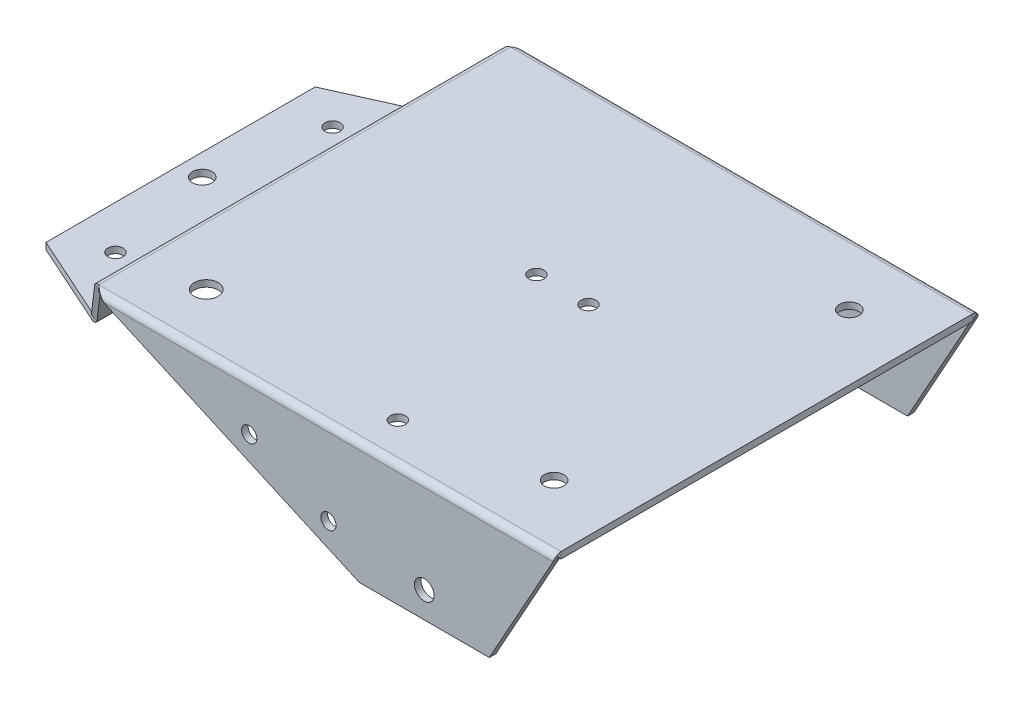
ISO-10303-21;
HEADER;
FILE_DESCRIPTION(('STEP AP214'),'2;1');
FILE_NAME('part.step','',(''),(''),'','','');
FILE_SCHEMA(('AUTOMOTIVE_DESIGN { 1 0 10303 214 1 1 1 1 }'));
ENDSEC;
DATA;
#1=APPLICATION_CONTEXT('core data for automotive mechanical design processes');
#2=APPLICATION_PROTOCOL_DEFINITION('international standard','automotive_design',2000,#1);
#3=PRODUCT_CONTEXT('',#1,'mechanical');
#4=PRODUCT('Part','Part','',(#3));
#5=PRODUCT_RELATED_PRODUCT_CATEGORY('part','',(#4));
#6=PRODUCT_DEFINITION_FORMATION('','',#4);
#7=PRODUCT_DEFINITION_CONTEXT('part definition',#1,'design');
#8=PRODUCT_DEFINITION('design','',#6,#7);
#9=PRODUCT_DEFINITION_SHAPE('','',#8);
#10=(LENGTH_UNIT() NAMED_UNIT(*) SI_UNIT(.MILLI.,.METRE.));
#11=(NAMED_UNIT(*) PLANE_ANGLE_UNIT() SI_UNIT($,.RADIAN.));
#12=(NAMED_UNIT(*) SI_UNIT($,.STERADIAN.) SOLID_ANGLE_UNIT());
#13=UNCERTAINTY_MEASURE_WITH_UNIT(LENGTH_MEASURE(1.E-05),#10,'distance_accuracy_value','');
#14=(GEOMETRIC_REPRESENTATION_CONTEXT(3) GLOBAL_UNCERTAINTY_ASSIGNED_CONTEXT((#13)) GLOBAL_UNIT_ASSIGNED_CONTEXT((#10,
#11,#12)) REPRESENTATION_CONTEXT('',''));
#15=CARTESIAN_POINT('',(0.,0.,0.));
#16=DIRECTION('',(0.,0.,1.));
#17=DIRECTION('',(1.,0.,0.));
#18=AXIS2_PLACEMENT_3D('',#15,#16,#17);
#19=CARTESIAN_POINT('',(17.368276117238,-31.7225733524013,0.));
#20=DIRECTION('',(0.86602540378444,-0.499999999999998,0.));
#21=DIRECTION('',(0.,0.,-1.));
#22=AXIS2_PLACEMENT_3D('',#19,#20,#21);
#23=PLANE('',#22);
#24=DIRECTION('',(-0.456134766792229,-0.790048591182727,0.40959040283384));
#25=VECTOR('',#24,1.);
#26=CARTESIAN_POINT('',(17.368276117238,-31.7225733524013,-31.));
#27=LINE('',#26,#25);
#28=CARTESIAN_POINT('',(35.2500110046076,-0.750500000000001,-47.0570680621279));
#29=VERTEX_POINT('',#28);
#30=CARTESIAN_POINT('',(27.5648874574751,-14.0615244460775,-40.156140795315));
#31=VERTEX_POINT('',#30);
#32=EDGE_CURVE('E123',#29,#31,#27,.T.);
#33=ORIENTED_EDGE('',*,*,#32,.T.);
#34=DIRECTION('',(0.,0.,1.));
#35=VECTOR('',#34,1.);
#36=CARTESIAN_POINT('',(27.5648874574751,-14.0615244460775,0.));
#37=LINE('',#36,#35);
#38=CARTESIAN_POINT('',(27.5648874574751,-14.0615244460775,40.156140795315));
#39=VERTEX_POINT('',#38);
#40=EDGE_CURVE('E116',#31,#39,#37,.T.);
#41=ORIENTED_EDGE('',*,*,#40,.T.);
#42=DIRECTION('',(0.456134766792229,0.790048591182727,0.40959040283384));
#43=VECTOR('',#42,1.);
#44=CARTESIAN_POINT('',(17.368276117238,-31.7225733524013,31.));
#45=LINE('',#44,#43);
#46=CARTESIAN_POINT('',(35.2500110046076,-0.750500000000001,47.0570680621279));
#47=VERTEX_POINT('',#46);
#48=EDGE_CURVE('E131',#39,#47,#45,.T.);
#49=ORIENTED_EDGE('',*,*,#48,.T.);
#50=DIRECTION('',(0.,0.,1.));
#51=VECTOR('',#50,1.);
#52=CARTESIAN_POINT('',(35.2500110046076,-0.750500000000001,0.));
#53=LINE('',#52,#51);
#54=EDGE_CURVE('E433',#29,#47,#53,.T.);
#55=ORIENTED_EDGE('',*,*,#54,.F.);
#56=EDGE_LOOP('',(#33,#41,#49,#55));
#57=FACE_BOUND('',#56,.T.);
#58=ADVANCED_FACE('F104',(#57),#23,.F.);
#59=CARTESIAN_POINT('',(0.,0.,0.));
#60=DIRECTION('',(0.,-1.,0.));
#61=DIRECTION('',(0.,0.,-1.));
#62=AXIS2_PLACEMENT_3D('',#59,#60,#61);
#63=PLANE('',#62);
#64=CARTESIAN_POINT('',(96.92,0.,-5.));
#65=DIRECTION('',(0.,1.,0.));
#66=DIRECTION('',(0.,0.,1.));
#67=AXIS2_PLACEMENT_3D('',#64,#65,#66);
#68=CIRCLE('',#67,1.75);
#69=CARTESIAN_POINT('',(96.92,0.,-3.25));
#70=VERTEX_POINT('',#69);
#71=EDGE_CURVE('E597',#70,#70,#68,.T.);
#72=ORIENTED_EDGE('',*,*,#71,.F.);
#73=EDGE_LOOP('',(#72));
#74=FACE_BOUND('',#73,.T.);
#75=CARTESIAN_POINT('',(84.92,0.,-5.));
#76=DIRECTION('',(0.,1.,0.));
#77=DIRECTION('',(0.,0.,1.));
#78=AXIS2_PLACEMENT_3D('',#75,#76,#77);
#79=CIRCLE('',#78,1.75);
#80=CARTESIAN_POINT('',(84.92,0.,-3.25));
#81=VERTEX_POINT('',#80);
#82=EDGE_CURVE('E596',#81,#81,#79,.T.);
#83=ORIENTED_EDGE('',*,*,#82,.F.);
#84=EDGE_LOOP('',(#83));
#85=FACE_BOUND('',#84,.T.);
#86=CARTESIAN_POINT('',(98.,0.,40.));
#87=DIRECTION('',(0.,1.,0.));
#88=DIRECTION('',(0.,0.,1.));
#89=AXIS2_PLACEMENT_3D('',#86,#87,#88);
#90=CIRCLE('',#89,1.75);
#91=CARTESIAN_POINT('',(98.,0.,41.75));
#92=VERTEX_POINT('',#91);
#93=EDGE_CURVE('E604',#92,#92,#90,.T.);
#94=ORIENTED_EDGE('',*,*,#93,.F.);
#95=EDGE_LOOP('',(#94));
#96=FACE_BOUND('',#95,.T.);
#97=CARTESIAN_POINT('',(49.8636363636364,0.,36.));
#98=DIRECTION('',(0.,1.,0.));
#99=DIRECTION('',(0.,0.,1.));
#100=AXIS2_PLACEMENT_3D('',#97,#98,#99);
#101=CIRCLE('',#100,2.75);
#102=CARTESIAN_POINT('',(49.8636363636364,0.,38.75));
#103=VERTEX_POINT('',#102);
#104=EDGE_CURVE('E610',#103,#103,#101,.T.);
#105=ORIENTED_EDGE('',*,*,#104,.F.);
#106=EDGE_LOOP('',(#105));
#107=FACE_BOUND('',#106,.T.);
#108=CARTESIAN_POINT('',(128.,0.,34.));
#109=DIRECTION('',(0.,1.,0.));
#110=DIRECTION('',(0.,0.,-1.));
#111=AXIS2_PLACEMENT_3D('',#108,#109,#110);
#112=CIRCLE('',#111,2.25000000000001);
#113=CARTESIAN_POINT('',(128.,0.,31.75));
#114=VERTEX_POINT('',#113);
#115=EDGE_CURVE('E616',#114,#114,#112,.T.);
#116=ORIENTED_EDGE('',*,*,#115,.F.);
#117=EDGE_LOOP('',(#116));
#118=FACE_BOUND('',#117,.T.);
#119=CARTESIAN_POINT('',(128.,0.,-34.));
#120=DIRECTION('',(0.,1.,0.));
#121=DIRECTION('',(0.,0.,1.));
#122=AXIS2_PLACEMENT_3D('',#119,#120,#121);
#123=CIRCLE('',#122,2.25000000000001);
#124=CARTESIAN_POINT('',(128.,0.,-31.75));
#125=VERTEX_POINT('',#124);
#126=EDGE_CURVE('E622',#125,#125,#123,.T.);
#127=ORIENTED_EDGE('',*,*,#126,.F.);
#128=EDGE_LOOP('',(#127));
#129=FACE_BOUND('',#128,.T.);
#130=DIRECTION('',(-1.,0.,0.));
#131=VECTOR('',#130,1.);
#132=CARTESIAN_POINT('',(0.,0.,-47.4101659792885));
#133=LINE('',#132,#131);
#134=CARTESIAN_POINT('',(143.,0.,-47.4101659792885));
#135=VERTEX_POINT('',#134);
#136=CARTESIAN_POINT('',(36.549915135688,0.,-47.4101659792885));
#137=VERTEX_POINT('',#136);
#138=EDGE_CURVE('E635',#135,#137,#133,.T.);
#139=ORIENTED_EDGE('',*,*,#138,.T.);
#140=DIRECTION('',(0.,0.,1.));
#141=VECTOR('',#140,1.);
#142=CARTESIAN_POINT('',(36.549915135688,0.,0.));
#143=LINE('',#142,#141);
#144=CARTESIAN_POINT('',(36.549915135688,0.,47.4101659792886));
#145=VERTEX_POINT('',#144);
#146=EDGE_CURVE('E736',#137,#145,#143,.T.);
#147=ORIENTED_EDGE('',*,*,#146,.T.);
#148=DIRECTION('',(-1.,0.,0.));
#149=VECTOR('',#148,1.);
#150=CARTESIAN_POINT('',(0.,0.,47.4101659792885));
#151=LINE('',#150,#149);
#152=CARTESIAN_POINT('',(143.,0.,47.4101659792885));
#153=VERTEX_POINT('',#152);
#154=EDGE_CURVE('E655',#153,#145,#151,.T.);
#155=ORIENTED_EDGE('',*,*,#154,.F.);
#156=DIRECTION('',(0.,0.,-1.));
#157=VECTOR('',#156,1.);
#158=CARTESIAN_POINT('',(143.,0.,-48.));
#159=LINE('',#158,#157);
#160=EDGE_CURVE('E628',#153,#135,#159,.T.);
#161=ORIENTED_EDGE('',*,*,#160,.T.);
#162=EDGE_LOOP('',(#139,#147,#155,#161));
#163=FACE_BOUND('',#162,.T.);
#164=ADVANCED_FACE('F497',(#74,#85,#96,#107,#118,#129,#163),#63,.F.);
#165=CARTESIAN_POINT('',(143.,-1.5,-48.));
#166=DIRECTION('',(1.,0.,0.));
#167=DIRECTION('',(0.,0.,-1.));
#168=AXIS2_PLACEMENT_3D('',#165,#166,#167);
#169=PLANE('',#168);
#170=ORIENTED_EDGE('',*,*,#160,.F.);
#171=DIRECTION('',(0.,-1.,0.));
#172=VECTOR('',#171,1.);
#173=CARTESIAN_POINT('',(143.,-1.49999999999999,47.4101659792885));
#174=LINE('',#173,#172);
#175=CARTESIAN_POINT('',(143.,-1.50014446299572,47.410514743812));
#176=VERTEX_POINT('',#175);
#177=EDGE_CURVE('E650',#153,#176,#174,.T.);
#178=ORIENTED_EDGE('',*,*,#177,.T.);
#179=DIRECTION('',(0.,0.,-1.));
#180=VECTOR('',#179,1.);
#181=CARTESIAN_POINT('',(143.,-1.5,-48.));
#182=LINE('',#181,#180);
#183=CARTESIAN_POINT('',(143.,-1.50014446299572,-47.410514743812));
#184=VERTEX_POINT('',#183);
#185=EDGE_CURVE('E638',#176,#184,#182,.T.);
#186=ORIENTED_EDGE('',*,*,#185,.T.);
#187=DIRECTION('',(0.,-1.,0.));
#188=VECTOR('',#187,1.);
#189=CARTESIAN_POINT('',(143.,-1.5,-47.4101659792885));
#190=LINE('',#189,#188);
#191=EDGE_CURVE('E631',#135,#184,#190,.T.);
#192=ORIENTED_EDGE('',*,*,#191,.F.);
#193=EDGE_LOOP('',(#170,#178,#186,#192));
#194=FACE_BOUND('',#193,.T.);
#195=ADVANCED_FACE('F501',(#194),#169,.T.);
#196=CARTESIAN_POINT('',(0.,-1.5,0.));
#197=DIRECTION('',(0.,-1.,0.));
#198=DIRECTION('',(0.,0.,-1.));
#199=AXIS2_PLACEMENT_3D('',#196,#197,#198);
#200=PLANE('',#199);
#201=DIRECTION('',(0.,0.,1.));
#202=VECTOR('',#201,1.);
#203=CARTESIAN_POINT('',(36.549915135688,-1.5,0.));
#204=LINE('',#203,#202);
#205=CARTESIAN_POINT('',(36.549915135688,-1.5,-47.4101659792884));
#206=VERTEX_POINT('',#205);
#207=CARTESIAN_POINT('',(36.549915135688,-1.5,47.4101659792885));
#208=VERTEX_POINT('',#207);
#209=EDGE_CURVE('E660',#206,#208,#204,.T.);
#210=ORIENTED_EDGE('',*,*,#209,.F.);
#211=DIRECTION('',(-1.,0.,0.));
#212=VECTOR('',#211,1.);
#213=CARTESIAN_POINT('',(0.,-1.5,-47.4101659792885));
#214=LINE('',#213,#212);
#215=EDGE_CURVE('E642',#184,#206,#214,.T.);
#216=ORIENTED_EDGE('',*,*,#215,.F.);
#217=ORIENTED_EDGE('',*,*,#185,.F.);
#218=DIRECTION('',(-1.,0.,0.));
#219=VECTOR('',#218,1.);
#220=CARTESIAN_POINT('',(0.,-1.5,47.4101659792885));
#221=LINE('',#220,#219);
#222=EDGE_CURVE('E634',#176,#208,#221,.T.);
#223=ORIENTED_EDGE('',*,*,#222,.T.);
#224=EDGE_LOOP('',(#210,#216,#217,#223));
#225=FACE_BOUND('',#224,.T.);
#226=CARTESIAN_POINT('',(128.,-1.5,-34.));
#227=DIRECTION('',(0.,1.,0.));
#228=DIRECTION('',(0.,0.,1.));
#229=AXIS2_PLACEMENT_3D('',#226,#227,#228);
#230=CIRCLE('',#229,2.25000000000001);
#231=CARTESIAN_POINT('',(128.,-1.5,-31.75));
#232=VERTEX_POINT('',#231);
#233=EDGE_CURVE('E625',#232,#232,#230,.T.);
#234=ORIENTED_EDGE('',*,*,#233,.T.);
#235=EDGE_LOOP('',(#234));
#236=FACE_BOUND('',#235,.T.);
#237=CARTESIAN_POINT('',(128.,-1.5,34.));
#238=DIRECTION('',(0.,1.,0.));
#239=DIRECTION('',(0.,0.,-1.));
#240=AXIS2_PLACEMENT_3D('',#237,#238,#239);
#241=CIRCLE('',#240,2.25000000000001);
#242=CARTESIAN_POINT('',(128.,-1.5,31.75));
#243=VERTEX_POINT('',#242);
#244=EDGE_CURVE('E619',#243,#243,#241,.T.);
#245=ORIENTED_EDGE('',*,*,#244,.T.);
#246=EDGE_LOOP('',(#245));
#247=FACE_BOUND('',#246,.T.);
#248=CARTESIAN_POINT('',(49.8636363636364,-1.5,36.));
#249=DIRECTION('',(0.,1.,0.));
#250=DIRECTION('',(0.,0.,1.));
#251=AXIS2_PLACEMENT_3D('',#248,#249,#250);
#252=CIRCLE('',#251,2.75);
#253=CARTESIAN_POINT('',(49.8636363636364,-1.5,38.75));
#254=VERTEX_POINT('',#253);
#255=EDGE_CURVE('E613',#254,#254,#252,.T.);
#256=ORIENTED_EDGE('',*,*,#255,.T.);
#257=EDGE_LOOP('',(#256));
#258=FACE_BOUND('',#257,.T.);
#259=CARTESIAN_POINT('',(98.,-1.5,40.));
#260=DIRECTION('',(0.,1.,0.));
#261=DIRECTION('',(0.,0.,1.));
#262=AXIS2_PLACEMENT_3D('',#259,#260,#261);
#263=CIRCLE('',#262,1.75);
#264=CARTESIAN_POINT('',(98.,-1.5,41.75));
#265=VERTEX_POINT('',#264);
#266=EDGE_CURVE('E607',#265,#265,#263,.T.);
#267=ORIENTED_EDGE('',*,*,#266,.T.);
#268=EDGE_LOOP('',(#267));
#269=FACE_BOUND('',#268,.T.);
#270=CARTESIAN_POINT('',(84.92,-1.5,-5.));
#271=DIRECTION('',(0.,1.,0.));
#272=DIRECTION('',(0.,0.,1.));
#273=AXIS2_PLACEMENT_3D('',#270,#271,#272);
#274=CIRCLE('',#273,1.75);
#275=CARTESIAN_POINT('',(84.92,-1.5,-3.25));
#276=VERTEX_POINT('',#275);
#277=EDGE_CURVE('E601',#276,#276,#274,.T.);
#278=ORIENTED_EDGE('',*,*,#277,.T.);
#279=EDGE_LOOP('',(#278));
#280=FACE_BOUND('',#279,.T.);
#281=CARTESIAN_POINT('',(96.92,-1.5,-5.));
#282=DIRECTION('',(0.,1.,0.));
#283=DIRECTION('',(0.,0.,1.));
#284=AXIS2_PLACEMENT_3D('',#281,#282,#283);
#285=CIRCLE('',#284,1.75);
#286=CARTESIAN_POINT('',(96.92,-1.5,-3.25));
#287=VERTEX_POINT('',#286);
#288=EDGE_CURVE('E588',#287,#287,#285,.T.);
#289=ORIENTED_EDGE('',*,*,#288,.T.);
#290=EDGE_LOOP('',(#289));
#291=FACE_BOUND('',#290,.T.);
#292=ADVANCED_FACE('F506',(#225,#236,#247,#258,#269,#280,#291),#200,.T.);
#293=CARTESIAN_POINT('',(128.,-1.5,-34.));
#294=DIRECTION('',(0.,1.,0.));
#295=DIRECTION('',(0.,0.,1.));
#296=AXIS2_PLACEMENT_3D('',#293,#294,#295);
#297=CYLINDRICAL_SURFACE('',#296,2.25000000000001);
#298=ORIENTED_EDGE('',*,*,#233,.F.);
#299=EDGE_LOOP('',(#298));
#300=FACE_BOUND('',#299,.T.);
#301=ORIENTED_EDGE('',*,*,#126,.T.);
#302=EDGE_LOOP('',(#301));
#303=FACE_BOUND('',#302,.T.);
#304=ADVANCED_FACE('F513',(#300,#303),#297,.F.);
#305=CARTESIAN_POINT('',(128.,-1.5,34.));
#306=DIRECTION('',(0.,1.,0.));
#307=DIRECTION('',(0.,0.,1.));
#308=AXIS2_PLACEMENT_3D('',#305,#306,#307);
#309=CYLINDRICAL_SURFACE('',#308,2.25000000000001);
#310=ORIENTED_EDGE('',*,*,#244,.F.);
#311=EDGE_LOOP('',(#310));
#312=FACE_BOUND('',#311,.T.);
#313=ORIENTED_EDGE('',*,*,#115,.T.);
#314=EDGE_LOOP('',(#313));
#315=FACE_BOUND('',#314,.T.);
#316=ADVANCED_FACE('F518',(#312,#315),#309,.F.);
#317=CARTESIAN_POINT('',(49.8636363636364,-1.5,36.));
#318=DIRECTION('',(0.,1.,0.));
#319=DIRECTION('',(0.,0.,1.));
#320=AXIS2_PLACEMENT_3D('',#317,#318,#319);
#321=CYLINDRICAL_SURFACE('',#320,2.75);
#322=ORIENTED_EDGE('',*,*,#255,.F.);
#323=EDGE_LOOP('',(#322));
#324=FACE_BOUND('',#323,.T.);
#325=ORIENTED_EDGE('',*,*,#104,.T.);
#326=EDGE_LOOP('',(#325));
#327=FACE_BOUND('',#326,.T.);
#328=ADVANCED_FACE('F522',(#324,#327),#321,.F.);
#329=CARTESIAN_POINT('',(98.,-1.5,40.));
#330=DIRECTION('',(0.,1.,0.));
#331=DIRECTION('',(0.,0.,1.));
#332=AXIS2_PLACEMENT_3D('',#329,#330,#331);
#333=CYLINDRICAL_SURFACE('',#332,1.75);
#334=ORIENTED_EDGE('',*,*,#266,.F.);
#335=EDGE_LOOP('',(#334));
#336=FACE_BOUND('',#335,.T.);
#337=ORIENTED_EDGE('',*,*,#93,.T.);
#338=EDGE_LOOP('',(#337));
#339=FACE_BOUND('',#338,.T.);
#340=ADVANCED_FACE('F526',(#336,#339),#333,.F.);
#341=CARTESIAN_POINT('',(84.92,-1.5,-5.));
#342=DIRECTION('',(0.,1.,0.));
#343=DIRECTION('',(0.,0.,1.));
#344=AXIS2_PLACEMENT_3D('',#341,#342,#343);
#345=CYLINDRICAL_SURFACE('',#344,1.75);
#346=ORIENTED_EDGE('',*,*,#277,.F.);
#347=EDGE_LOOP('',(#346));
#348=FACE_BOUND('',#347,.T.);
#349=ORIENTED_EDGE('',*,*,#82,.T.);
#350=EDGE_LOOP('',(#349));
#351=FACE_BOUND('',#350,.T.);
#352=ADVANCED_FACE('F530',(#348,#351),#345,.F.);
#353=CARTESIAN_POINT('',(96.92,-1.5,-5.));
#354=DIRECTION('',(0.,1.,0.));
#355=DIRECTION('',(0.,0.,1.));
#356=AXIS2_PLACEMENT_3D('',#353,#354,#355);
#357=CYLINDRICAL_SURFACE('',#356,1.75);
#358=ORIENTED_EDGE('',*,*,#288,.F.);
#359=EDGE_LOOP('',(#358));
#360=FACE_BOUND('',#359,.T.);
#361=ORIENTED_EDGE('',*,*,#71,.T.);
#362=EDGE_LOOP('',(#361));
#363=FACE_BOUND('',#362,.T.);
#364=ADVANCED_FACE('F534',(#360,#363),#357,.F.);
#365=CARTESIAN_POINT('',(142.672314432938,-1.501,-48.9111659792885));
#366=CARTESIAN_POINT('',(142.726937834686,-1.30448667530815,-48.9111659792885));
#367=CARTESIAN_POINT('',(142.781542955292,-1.10811642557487,-48.8720989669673));
#368=CARTESIAN_POINT('',(142.890771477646,-0.745067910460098,-48.7217193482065));
#369=CARTESIAN_POINT('',(142.945376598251,-0.578588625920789,-48.6104891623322));
#370=CARTESIAN_POINT('',(143.,-0.439632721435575,-48.4715332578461));
#371=CARTESIAN_POINT('',(142.672314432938,-1.501,-47.4111659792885));
#372=CARTESIAN_POINT('',(142.726928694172,-1.50086910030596,-47.4111659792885));
#373=CARTESIAN_POINT('',(142.781542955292,-1.50073825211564,-47.4111399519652));
#374=CARTESIAN_POINT('',(142.890771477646,-1.50049638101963,-47.4110397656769));
#375=CARTESIAN_POINT('',(142.945385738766,-1.50038545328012,-47.410965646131));
#376=CARTESIAN_POINT('',(143.,-1.50029289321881,-47.4108730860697));
#377=B_SPLINE_SURFACE_WITH_KNOTS('',1,3,((#365,#366,#367,#368,#369,#370),(#371,#372,#373,#374,
#375,#376)),.UNSPECIFIED.,.F.,.F.,.F.,(2,2),(4,2,4),(0.,1.),(0.,0.5,1.),.UNSPECIFIED.);
#378=CARTESIAN_POINT('',(142.672314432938,-1.501,-47.4111659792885));
#379=CARTESIAN_POINT('',(142.672314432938,-1.501,-48.9111659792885));
#380=B_SPLINE_CURVE_WITH_KNOTS('',1,(#378,#379),.UNSPECIFIED.,.F.,.F.,(2,2),(0.,1.),.UNSPECIFIED.);
#381=CARTESIAN_POINT('',(142.672314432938,-1.501,-48.9111659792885));
#382=VERTEX_POINT('',#381);
#383=CARTESIAN_POINT('',(142.672314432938,-1.501,-47.4111659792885));
#384=VERTEX_POINT('',#383);
#385=EDGE_CURVE('E1013',#382,#384,#380,.F.);
#386=CARTESIAN_POINT('',(142.672314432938,-1.501,-48.9111659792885));
#387=CARTESIAN_POINT('',(142.726937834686,-1.30448667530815,-48.9111659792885));
#388=CARTESIAN_POINT('',(142.781542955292,-1.10811642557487,-48.8720989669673));
#389=CARTESIAN_POINT('',(142.890771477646,-0.745067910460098,-48.7217193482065));
#390=CARTESIAN_POINT('',(142.945376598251,-0.578588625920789,-48.6104891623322));
#391=CARTESIAN_POINT('',(143.,-0.439632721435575,-48.4715332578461));
#392=B_SPLINE_CURVE_WITH_KNOTS('',3,(#386,#387,#388,#389,#390,#391),.UNSPECIFIED.,.F.,.F.,(4,2,
4),(0.,0.5,1.),.UNSPECIFIED.);
#393=CARTESIAN_POINT('',(143.,-0.439632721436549,-48.4715332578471));
#394=VERTEX_POINT('',#393);
#395=EDGE_CURVE('E855',#382,#394,#392,.T.);
#396=CARTESIAN_POINT('',(143.,-0.439632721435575,-48.4715332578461));
#397=CARTESIAN_POINT('',(143.,-1.50029289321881,-47.4108730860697));
#398=B_SPLINE_CURVE_WITH_KNOTS('',1,(#396,#397),.UNSPECIFIED.,.F.,.F.,(2,2),(0.,1.),.UNSPECIFIED.);
#399=EDGE_CURVE('E600',#394,#184,#398,.T.);
#400=CARTESIAN_POINT('',(143.,-1.50029289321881,-47.4108730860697));
#401=CARTESIAN_POINT('',(142.945385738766,-1.50038545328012,-47.410965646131));
#402=CARTESIAN_POINT('',(142.890771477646,-1.50049638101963,-47.4110397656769));
#403=CARTESIAN_POINT('',(142.781542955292,-1.50073825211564,-47.4111399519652));
#404=CARTESIAN_POINT('',(142.726928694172,-1.50086910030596,-47.4111659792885));
#405=CARTESIAN_POINT('',(142.672314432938,-1.501,-47.4111659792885));
#406=B_SPLINE_CURVE_WITH_KNOTS('',3,(#400,#401,#402,#403,#404,#405),.UNSPECIFIED.,.F.,.F.,(4,2,
4),(0.,0.5,1.),.UNSPECIFIED.);
#407=EDGE_CURVE('E848',#384,#184,#406,.F.);
#408=ORIENTED_EDGE('',*,*,#385,.F.);
#409=ORIENTED_EDGE('',*,*,#395,.T.);
#410=ORIENTED_EDGE('',*,*,#399,.T.);
#411=ORIENTED_EDGE('',*,*,#407,.F.);
#412=EDGE_LOOP('',(#408,#409,#410,#411));
#413=FACE_BOUND('',#412,.T.);
#414=ADVANCED_FACE('F538',(#413),#377,.F.);
#415=CARTESIAN_POINT('',(143.,-1.501,-47.4101659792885));
#416=DIRECTION('',(-1.,0.,0.));
#417=DIRECTION('',(0.,0.,1.));
#418=AXIS2_PLACEMENT_3D('',#415,#416,#417);
#419=PLANE('',#418);
#420=ORIENTED_EDGE('',*,*,#399,.F.);
#421=CARTESIAN_POINT('',(143.,-1.501,-47.4101659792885));
#422=DIRECTION('',(1.,0.,0.));
#423=DIRECTION('',(0.,0.,-1.));
#424=AXIS2_PLACEMENT_3D('',#421,#422,#423);
#425=CIRCLE('',#424,1.501);
#426=EDGE_CURVE('E849',#394,#135,#425,.T.);
#427=ORIENTED_EDGE('',*,*,#426,.T.);
#428=ORIENTED_EDGE('',*,*,#191,.T.);
#429=EDGE_LOOP('',(#420,#427,#428));
#430=FACE_BOUND('',#429,.T.);
#431=ADVANCED_FACE('F547',(#430),#419,.F.);
#432=CARTESIAN_POINT('',(36.549915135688,0.015,-47.410165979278));
#433=CARTESIAN_POINT('',(36.768886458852,0.0150000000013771,-47.6086258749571));
#434=CARTESIAN_POINT('',(36.9878222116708,-0.0244574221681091,-47.8069757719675));
#435=CARTESIAN_POINT('',(37.4257292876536,-0.176339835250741,-48.1736523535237));
#436=CARTESIAN_POINT('',(37.644682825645,-0.288705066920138,-48.3418188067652));
#437=CARTESIAN_POINT('',(38.0825899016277,-0.569347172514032,-48.6224609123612));
#438=CARTESIAN_POINT('',(38.3015434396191,-0.73751362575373,-48.7348261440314));
#439=CARTESIAN_POINT('',(38.7394505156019,-1.10419020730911,-48.8867085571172));
#440=CARTESIAN_POINT('',(38.9583862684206,-1.30254010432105,-48.9261659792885));
#441=CARTESIAN_POINT('',(39.1773575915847,-1.501,-48.9261659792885));
#442=CARTESIAN_POINT('',(36.549915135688,0.,-47.4101659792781));
#443=CARTESIAN_POINT('',(36.7688862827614,1.36346686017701E-12,-47.6066622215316));
#444=CARTESIAN_POINT('',(36.9878222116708,-0.0390670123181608,-47.8030495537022));
#445=CARTESIAN_POINT('',(37.4257292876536,-0.189446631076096,-48.1660980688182));
#446=CARTESIAN_POINT('',(37.644682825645,-0.300700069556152,-48.3326006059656));
#447=CARTESIAN_POINT('',(38.0825899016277,-0.578565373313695,-48.6104659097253));
#448=CARTESIAN_POINT('',(38.3015434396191,-0.745067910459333,-48.7217193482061));
#449=CARTESIAN_POINT('',(38.7394505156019,-1.10811642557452,-48.8720989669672));
#450=CARTESIAN_POINT('',(38.9583864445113,-1.30450375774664,-48.9111659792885));
#451=CARTESIAN_POINT('',(39.1773575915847,-1.501,-48.9111659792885));
#452=CARTESIAN_POINT('',(36.549915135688,-1.5,-47.4101659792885));
#453=CARTESIAN_POINT('',(36.7688686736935,-1.5,-47.4102968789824));
#454=CARTESIAN_POINT('',(36.9878222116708,-1.50002602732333,-47.4104277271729));
#455=CARTESIAN_POINT('',(37.4257292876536,-1.50012621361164,-47.4106695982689));
#456=CARTESIAN_POINT('',(37.644682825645,-1.5002003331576,-47.4107805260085));
#457=CARTESIAN_POINT('',(38.0825899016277,-1.50038545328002,-47.4109656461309));
#458=CARTESIAN_POINT('',(38.3015434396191,-1.50049638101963,-47.4110397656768));
#459=CARTESIAN_POINT('',(38.7394505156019,-1.50073825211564,-47.4111399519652));
#460=CARTESIAN_POINT('',(38.9584040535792,-1.50086910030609,-47.4111659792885));
#461=CARTESIAN_POINT('',(39.1773575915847,-1.501,-47.4111659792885));
#462=B_SPLINE_SURFACE_WITH_KNOTS('',1,3,((#432,#433,#434,#435,#436,#437,#438,#439,#440,#441),
(#442,#443,#444,#445,#446,#447,#448,#449,#450,#451),(#452,#453,#454,#455,#456,#457,#458,#459,
#460,#461)),.UNSPECIFIED.,.F.,.F.,.F.,(2,1,2),(4,2,2,2,4),(-0.01,0.,1.),(0.,0.25,0.5,0.75,1.),.UNSPECIFIED.);
#463=CARTESIAN_POINT('',(36.549915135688,0.,-47.4101659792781));
#464=CARTESIAN_POINT('',(36.6205857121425,2.35648005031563E-05,-47.4735793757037));
#465=CARTESIAN_POINT('',(36.6912530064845,-0.00401739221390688,-47.5369915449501));
#466=CARTESIAN_POINT('',(36.8325778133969,-0.0200609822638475,-47.6627963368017));
#467=CARTESIAN_POINT('',(36.9032353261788,-0.0320627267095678,-47.7251890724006));
#468=CARTESIAN_POINT('',(37.0442893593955,-0.0638012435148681,-47.8477233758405));
#469=CARTESIAN_POINT('',(37.1146858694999,-0.0835089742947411,-47.9078724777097));
#470=CARTESIAN_POINT('',(37.2554774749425,-0.130338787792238,-48.0252088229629));
#471=CARTESIAN_POINT('',(37.3258725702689,-0.157460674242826,-48.0823961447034));
#472=CARTESIAN_POINT('',(37.4669313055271,-0.218810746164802,-48.1931174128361));
#473=CARTESIAN_POINT('',(37.5375949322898,-0.253065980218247,-48.2466363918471));
#474=CARTESIAN_POINT('',(37.6789563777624,-0.328081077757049,-48.3489349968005));
#475=CARTESIAN_POINT('',(37.7496541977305,-0.36884382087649,-48.3977125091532));
#476=CARTESIAN_POINT('',(37.8910685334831,-0.456220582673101,-48.4897322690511));
#477=CARTESIAN_POINT('',(37.9617850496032,-0.502836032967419,-48.5329731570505));
#478=CARTESIAN_POINT('',(38.1031831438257,-0.601143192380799,-48.6131965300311));
#479=CARTESIAN_POINT('',(38.1738647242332,-0.652832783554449,-48.6501816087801));
#480=CARTESIAN_POINT('',(38.3220858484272,-0.76569202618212,-48.7205714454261));
#481=CARTESIAN_POINT('',(38.3996263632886,-0.827294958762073,-48.7532821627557));
#482=CARTESIAN_POINT('',(38.5547171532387,-0.954446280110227,-48.8098535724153));
#483=CARTESIAN_POINT('',(38.6322674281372,-1.01999523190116,-48.8337129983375));
#484=CARTESIAN_POINT('',(38.7877367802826,-1.15409441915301,-48.8721983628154));
#485=CARTESIAN_POINT('',(38.8656558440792,-1.22265753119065,-48.8867795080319));
#486=CARTESIAN_POINT('',(39.0215013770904,-1.36114576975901,-48.9062810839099));
#487=CARTESIAN_POINT('',(39.0994278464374,-1.43107099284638,-48.9112008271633));
#488=CARTESIAN_POINT('',(39.1773575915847,-1.501,-48.9111659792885));
#489=B_SPLINE_CURVE_WITH_KNOTS('',3,(#463,#464,#465,#466,#467,#468,#469,#470,#471,#472,#473,
#474,#475,#476,#477,#478,#479,#480,#481,#482,#483,#484,#485,#486,#487,#488),.UNSPECIFIED.,.F.,
.F.,(4,2,2,2,2,2,2,2,2,2,2,2,4),(0.,0.284760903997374,0.569490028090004,0.853156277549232,
1.13681501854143,1.42156960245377,1.70645054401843,1.99140130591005,2.27623363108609,
2.58866175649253,2.90113456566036,3.21510469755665,3.52909716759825),.UNSPECIFIED.);
#490=CARTESIAN_POINT('',(39.1773575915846,-1.501,-48.9111659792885));
#491=VERTEX_POINT('',#490);
#492=EDGE_CURVE('E847',#137,#491,#489,.T.);
#493=CARTESIAN_POINT('',(39.1773575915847,-1.501,-48.9261659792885));
#494=CARTESIAN_POINT('',(39.1773575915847,-1.501,-48.9111659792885));
#495=CARTESIAN_POINT('',(39.1773575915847,-1.501,-47.4111659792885));
#496=B_SPLINE_CURVE_WITH_KNOTS('',1,(#493,#494,#495),.UNSPECIFIED.,.F.,.F.,(2,1,2),(-0.01,0.,
1.),.UNSPECIFIED.);
#497=CARTESIAN_POINT('',(39.1773575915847,-1.501,-47.4111659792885));
#498=VERTEX_POINT('',#497);
#499=EDGE_CURVE('E1019',#498,#491,#496,.F.);
#500=CARTESIAN_POINT('',(36.549915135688,-1.5,-47.4101659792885));
#501=CARTESIAN_POINT('',(36.6593919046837,-1.49999991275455,-47.4102314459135));
#502=CARTESIAN_POINT('',(36.7688686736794,-1.50000642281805,-47.4102968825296));
#503=CARTESIAN_POINT('',(36.9878222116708,-1.50003200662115,-47.4104252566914));
#504=CARTESIAN_POINT('',(37.0972989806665,-1.50005108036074,-47.410488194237));
#505=CARTESIAN_POINT('',(37.3162525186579,-1.50010116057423,-47.4106091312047));
#506=CARTESIAN_POINT('',(37.4257292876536,-1.50013216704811,-47.4106671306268));
#507=CARTESIAN_POINT('',(37.644682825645,-1.50020489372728,-47.4107759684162));
#508=CARTESIAN_POINT('',(37.7541595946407,-1.50024661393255,-47.4108268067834));
#509=CARTESIAN_POINT('',(37.973113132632,-1.50033917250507,-47.4109193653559));
#510=CARTESIAN_POINT('',(38.0825899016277,-1.5003900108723,-47.4109610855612));
#511=CARTESIAN_POINT('',(38.3015434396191,-1.50049884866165,-47.4110338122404));
#512=CARTESIAN_POINT('',(38.4110202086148,-1.50055684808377,-47.4110648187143));
#513=CARTESIAN_POINT('',(38.6299737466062,-1.50067778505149,-47.4111148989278));
#514=CARTESIAN_POINT('',(38.7394505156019,-1.5007407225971,-47.4111339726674));
#515=CARTESIAN_POINT('',(38.9584040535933,-1.50086909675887,-47.4111595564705));
#516=CARTESIAN_POINT('',(39.067880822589,-1.50093453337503,-47.411166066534));
#517=CARTESIAN_POINT('',(39.1773575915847,-1.501,-47.4111659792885));
#518=B_SPLINE_CURVE_WITH_KNOTS('',3,(#500,#501,#502,#503,#504,#505,#506,#507,#508,#509,#510,
#511,#512,#513,#514,#515,#516,#517),.UNSPECIFIED.,.F.,.F.,(4,2,2,2,2,2,2,2,4),(0.,
0.328430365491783,0.656860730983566,0.98529109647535,1.31372146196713,1.64215182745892,
1.9705821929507,2.29901255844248,2.62744292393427),.UNSPECIFIED.);
#519=EDGE_CURVE('E853',#206,#498,#518,.T.);
#520=CARTESIAN_POINT('',(36.549915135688,-1.5,-47.4101659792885));
#521=CARTESIAN_POINT('',(36.549915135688,0.,-47.4101659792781));
#522=CARTESIAN_POINT('',(36.549915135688,0.015,-47.410165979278));
#523=B_SPLINE_CURVE_WITH_KNOTS('',1,(#520,#521,#522),.UNSPECIFIED.,.F.,.F.,(2,1,2),(-0.01,0.99,
1.),.UNSPECIFIED.);
#524=EDGE_CURVE('E584',#206,#137,#523,.T.);
#525=ORIENTED_EDGE('',*,*,#492,.T.);
#526=ORIENTED_EDGE('',*,*,#499,.F.);
#527=ORIENTED_EDGE('',*,*,#519,.F.);
#528=ORIENTED_EDGE('',*,*,#524,.T.);
#529=EDGE_LOOP('',(#525,#526,#527,#528));
#530=FACE_BOUND('',#529,.T.);
#531=ADVANCED_FACE('F540',(#530),#462,.F.);
#532=CARTESIAN_POINT('',(-16.6922307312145,-1.501,-47.4101659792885));
#533=DIRECTION('',(1.,0.,0.));
#534=DIRECTION('',(0.,0.,-1.));
#535=AXIS2_PLACEMENT_3D('',#532,#533,#534);
#536=CYLINDRICAL_SURFACE('',#535,0.001);
#537=ORIENTED_EDGE('',*,*,#215,.T.);
#538=ORIENTED_EDGE('',*,*,#519,.T.);
#539=DIRECTION('',(-1.,0.,0.));
#540=VECTOR('',#539,1.);
#541=CARTESIAN_POINT('',(0.,-1.501,-47.4111659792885));
#542=LINE('',#541,#540);
#543=EDGE_CURVE('E1042',#384,#498,#542,.T.);
#544=ORIENTED_EDGE('',*,*,#543,.F.);
#545=ORIENTED_EDGE('',*,*,#407,.T.);
#546=EDGE_LOOP('',(#537,#538,#544,#545));
#547=FACE_BOUND('',#546,.T.);
#548=ADVANCED_FACE('F546',(#547),#536,.F.);
#549=CARTESIAN_POINT('',(-16.6922307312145,-1.501,-47.4101659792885));
#550=DIRECTION('',(1.,0.,0.));
#551=DIRECTION('',(0.,0.,-1.));
#552=AXIS2_PLACEMENT_3D('',#549,#550,#551);
#553=CYLINDRICAL_SURFACE('',#552,1.501);
#554=ORIENTED_EDGE('',*,*,#138,.F.);
#555=ORIENTED_EDGE('',*,*,#426,.F.);
#556=ORIENTED_EDGE('',*,*,#395,.F.);
#557=DIRECTION('',(-1.,0.,0.));
#558=VECTOR('',#557,1.);
#559=CARTESIAN_POINT('',(0.,-1.501,-48.9111659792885));
#560=LINE('',#559,#558);
#561=EDGE_CURVE('E997',#382,#491,#560,.T.);
#562=ORIENTED_EDGE('',*,*,#561,.T.);
#563=ORIENTED_EDGE('',*,*,#492,.F.);
#564=EDGE_LOOP('',(#554,#555,#556,#562,#563));
#565=FACE_BOUND('',#564,.T.);
#566=ADVANCED_FACE('F880',(#565),#553,.T.);
#567=CARTESIAN_POINT('',(98.,-27.9111659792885,-47.4111659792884));
#568=DIRECTION('',(0.,-1.,0.));
#569=DIRECTION('',(-1.,0.,0.));
#570=AXIS2_PLACEMENT_3D('',#567,#568,#569);
#571=PLANE('',#570);
#572=DIRECTION('',(-1.,0.,0.));
#573=VECTOR('',#572,1.);
#574=CARTESIAN_POINT('',(98.,-27.9111659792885,-48.9111659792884));
#575=LINE('',#574,#573);
#576=CARTESIAN_POINT('',(128.,-27.9111659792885,-48.9111659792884));
#577=VERTEX_POINT('',#576);
#578=CARTESIAN_POINT('',(98.,-27.9111659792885,-48.9111659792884));
#579=VERTEX_POINT('',#578);
#580=EDGE_CURVE('E1014',#577,#579,#575,.T.);
#581=ORIENTED_EDGE('',*,*,#580,.F.);
#582=DIRECTION('',(0.,0.,-1.));
#583=VECTOR('',#582,1.);
#584=CARTESIAN_POINT('',(128.,-27.9111659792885,-47.4111659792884));
#585=LINE('',#584,#583);
#586=CARTESIAN_POINT('',(128.,-27.9111659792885,-47.4111659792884));
#587=VERTEX_POINT('',#586);
#588=EDGE_CURVE('E860',#587,#577,#585,.T.);
#589=ORIENTED_EDGE('',*,*,#588,.F.);
#590=DIRECTION('',(-1.,0.,0.));
#591=VECTOR('',#590,1.);
#592=CARTESIAN_POINT('',(98.,-27.9111659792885,-47.4111659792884));
#593=LINE('',#592,#591);
#594=CARTESIAN_POINT('',(98.,-27.9111659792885,-47.4111659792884));
#595=VERTEX_POINT('',#594);
#596=EDGE_CURVE('E863',#587,#595,#593,.T.);
#597=ORIENTED_EDGE('',*,*,#596,.T.);
#598=DIRECTION('',(0.,0.,-1.));
#599=VECTOR('',#598,1.);
#600=CARTESIAN_POINT('',(98.,-27.9111659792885,-47.4111659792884));
#601=LINE('',#600,#599);
#602=EDGE_CURVE('E1002',#595,#579,#601,.T.);
#603=ORIENTED_EDGE('',*,*,#602,.T.);
#604=EDGE_LOOP('',(#581,#589,#597,#603));
#605=FACE_BOUND('',#604,.T.);
#606=ADVANCED_FACE('F831',(#605),#571,.T.);
#607=CARTESIAN_POINT('',(90.9252566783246,-19.2539142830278,-47.4111659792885));
#608=DIRECTION('',(0.,0.,-1.));
#609=DIRECTION('',(0.,1.,0.));
#610=AXIS2_PLACEMENT_3D('',#607,#608,#609);
#611=CYLINDRICAL_SURFACE('',#610,1.75);
#612=CARTESIAN_POINT('',(90.9252566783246,-19.2539142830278,-47.4111659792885));
#613=DIRECTION('',(0.,0.,-1.));
#614=DIRECTION('',(0.,1.,0.));
#615=AXIS2_PLACEMENT_3D('',#612,#613,#614);
#616=CIRCLE('',#615,1.75);
#617=CARTESIAN_POINT('',(90.9252566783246,-17.5039142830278,-47.4111659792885));
#618=VERTEX_POINT('',#617);
#619=EDGE_CURVE('E1047',#618,#618,#616,.T.);
#620=ORIENTED_EDGE('',*,*,#619,.F.);
#621=EDGE_LOOP('',(#620));
#622=FACE_BOUND('',#621,.T.);
#623=CARTESIAN_POINT('',(90.9252566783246,-19.2539142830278,-48.9111659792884));
#624=DIRECTION('',(0.,0.,-1.));
#625=DIRECTION('',(0.,1.,0.));
#626=AXIS2_PLACEMENT_3D('',#623,#624,#625);
#627=CIRCLE('',#626,1.75);
#628=CARTESIAN_POINT('',(90.9252566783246,-17.5039142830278,-48.9111659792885));
#629=VERTEX_POINT('',#628);
#630=EDGE_CURVE('E1827',#629,#629,#627,.T.);
#631=ORIENTED_EDGE('',*,*,#630,.T.);
#632=EDGE_LOOP('',(#631));
#633=FACE_BOUND('',#632,.T.);
#634=ADVANCED_FACE('F1160',(#622,#633),#611,.F.);
#635=CARTESIAN_POINT('',(72.6798660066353,-11.062106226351,-47.4111659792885));
#636=DIRECTION('',(0.,0.,-1.));
#637=DIRECTION('',(0.,1.,0.));
#638=AXIS2_PLACEMENT_3D('',#635,#636,#637);
#639=CYLINDRICAL_SURFACE('',#638,1.75);
#640=CARTESIAN_POINT('',(72.6798660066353,-11.062106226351,-47.4111659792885));
#641=DIRECTION('',(0.,0.,-1.));
#642=DIRECTION('',(0.,1.,0.));
#643=AXIS2_PLACEMENT_3D('',#640,#641,#642);
#644=CIRCLE('',#643,1.75);
#645=CARTESIAN_POINT('',(72.6798660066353,-9.31210622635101,-47.4111659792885));
#646=VERTEX_POINT('',#645);
#647=EDGE_CURVE('E1815',#646,#646,#644,.T.);
#648=ORIENTED_EDGE('',*,*,#647,.F.);
#649=EDGE_LOOP('',(#648));
#650=FACE_BOUND('',#649,.T.);
#651=CARTESIAN_POINT('',(72.6798660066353,-11.062106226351,-48.9111659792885));
#652=DIRECTION('',(0.,0.,-1.));
#653=DIRECTION('',(0.,1.,0.));
#654=AXIS2_PLACEMENT_3D('',#651,#652,#653);
#655=CIRCLE('',#654,1.75);
#656=CARTESIAN_POINT('',(72.6798660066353,-9.31210622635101,-48.9111659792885));
#657=VERTEX_POINT('',#656);
#658=EDGE_CURVE('E1824',#657,#657,#655,.T.);
#659=ORIENTED_EDGE('',*,*,#658,.T.);
#660=EDGE_LOOP('',(#659));
#661=FACE_BOUND('',#660,.T.);
#662=ADVANCED_FACE('F1169',(#650,#661),#639,.F.);
#663=CARTESIAN_POINT('',(113.,-21.9111659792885,-47.4111659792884));
#664=DIRECTION('',(0.,0.,-1.));
#665=DIRECTION('',(0.,1.,0.));
#666=AXIS2_PLACEMENT_3D('',#663,#664,#665);
#667=CYLINDRICAL_SURFACE('',#666,2.25);
#668=CARTESIAN_POINT('',(113.,-21.9111659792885,-47.4111659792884));
#669=DIRECTION('',(0.,0.,-1.));
#670=DIRECTION('',(0.,1.,0.));
#671=AXIS2_PLACEMENT_3D('',#668,#669,#670);
#672=CIRCLE('',#671,2.25);
#673=CARTESIAN_POINT('',(113.,-19.6611659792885,-47.4111659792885));
#674=VERTEX_POINT('',#673);
#675=EDGE_CURVE('E1818',#674,#674,#672,.T.);
#676=ORIENTED_EDGE('',*,*,#675,.F.);
#677=EDGE_LOOP('',(#676));
#678=FACE_BOUND('',#677,.T.);
#679=CARTESIAN_POINT('',(113.,-21.9111659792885,-48.9111659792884));
#680=DIRECTION('',(0.,0.,-1.));
#681=DIRECTION('',(0.,1.,0.));
#682=AXIS2_PLACEMENT_3D('',#679,#680,#681);
#683=CIRCLE('',#682,2.25);
#684=CARTESIAN_POINT('',(113.,-19.6611659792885,-48.9111659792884));
#685=VERTEX_POINT('',#684);
#686=EDGE_CURVE('E1821',#685,#685,#683,.T.);
#687=ORIENTED_EDGE('',*,*,#686,.T.);
#688=EDGE_LOOP('',(#687));
#689=FACE_BOUND('',#688,.T.);
#690=ADVANCED_FACE('F1178',(#678,#689),#667,.F.);
#691=CARTESIAN_POINT('',(0.,47.0888340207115,-47.4111659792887));
#692=DIRECTION('',(0.,0.,1.));
#693=DIRECTION('',(0.,-1.,0.));
#694=AXIS2_PLACEMENT_3D('',#691,#692,#693);
#695=PLANE('',#694);
#696=ORIENTED_EDGE('',*,*,#675,.T.);
#697=EDGE_LOOP('',(#696));
#698=FACE_BOUND('',#697,.T.);
#699=ORIENTED_EDGE('',*,*,#647,.T.);
#700=EDGE_LOOP('',(#699));
#701=FACE_BOUND('',#700,.T.);
#702=ORIENTED_EDGE('',*,*,#619,.T.);
#703=EDGE_LOOP('',(#702));
#704=FACE_BOUND('',#703,.T.);
#705=DIRECTION('',(-0.485642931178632,-0.874157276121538,0.));
#706=VECTOR('',#705,1.);
#707=CARTESIAN_POINT('',(128.,-27.9111659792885,-47.4111659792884));
#708=LINE('',#707,#706);
#709=EDGE_CURVE('E1032',#384,#587,#708,.T.);
#710=ORIENTED_EDGE('',*,*,#709,.F.);
#711=ORIENTED_EDGE('',*,*,#543,.T.);
#712=DIRECTION('',(-0.912269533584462,0.40959040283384,0.));
#713=VECTOR('',#712,1.);
#714=CARTESIAN_POINT('',(0.,16.0888340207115,-47.4111659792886));
#715=LINE('',#714,#713);
#716=EDGE_CURVE('E1046',#595,#498,#715,.T.);
#717=ORIENTED_EDGE('',*,*,#716,.F.);
#718=ORIENTED_EDGE('',*,*,#596,.F.);
#719=EDGE_LOOP('',(#710,#711,#717,#718));
#720=FACE_BOUND('',#719,.T.);
#721=ADVANCED_FACE('F1040',(#698,#701,#704,#720),#695,.T.);
#722=CARTESIAN_POINT('',(0.,16.0888340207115,-47.4111659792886));
#723=DIRECTION('',(-0.40959040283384,-0.912269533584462,0.));
#724=DIRECTION('',(-0.912269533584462,0.40959040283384,0.));
#725=AXIS2_PLACEMENT_3D('',#722,#723,#724);
#726=PLANE('',#725);
#727=ORIENTED_EDGE('',*,*,#716,.T.);
#728=ORIENTED_EDGE('',*,*,#499,.T.);
#729=DIRECTION('',(-0.912269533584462,0.40959040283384,0.));
#730=VECTOR('',#729,1.);
#731=CARTESIAN_POINT('',(0.,16.0888340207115,-48.9111659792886));
#732=LINE('',#731,#730);
#733=EDGE_CURVE('E1011',#579,#491,#732,.T.);
#734=ORIENTED_EDGE('',*,*,#733,.F.);
#735=ORIENTED_EDGE('',*,*,#602,.F.);
#736=EDGE_LOOP('',(#727,#728,#734,#735));
#737=FACE_BOUND('',#736,.T.);
#738=ADVANCED_FACE('F1197',(#737),#726,.T.);
#739=CARTESIAN_POINT('',(0.,47.0888340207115,-48.9111659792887));
#740=DIRECTION('',(0.,0.,1.));
#741=DIRECTION('',(0.,-1.,0.));
#742=AXIS2_PLACEMENT_3D('',#739,#740,#741);
#743=PLANE('',#742);
#744=ORIENTED_EDGE('',*,*,#561,.F.);
#745=DIRECTION('',(-0.485642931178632,-0.874157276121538,0.));
#746=VECTOR('',#745,1.);
#747=CARTESIAN_POINT('',(128.,-27.9111659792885,-48.9111659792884));
#748=LINE('',#747,#746);
#749=EDGE_CURVE('E1017',#382,#577,#748,.T.);
#750=ORIENTED_EDGE('',*,*,#749,.T.);
#751=ORIENTED_EDGE('',*,*,#580,.T.);
#752=ORIENTED_EDGE('',*,*,#733,.T.);
#753=EDGE_LOOP('',(#744,#750,#751,#752));
#754=FACE_BOUND('',#753,.T.);
#755=ORIENTED_EDGE('',*,*,#630,.F.);
#756=EDGE_LOOP('',(#755));
#757=FACE_BOUND('',#756,.T.);
#758=ORIENTED_EDGE('',*,*,#658,.F.);
#759=EDGE_LOOP('',(#758));
#760=FACE_BOUND('',#759,.T.);
#761=ORIENTED_EDGE('',*,*,#686,.F.);
#762=EDGE_LOOP('',(#761));
#763=FACE_BOUND('',#762,.T.);
#764=ADVANCED_FACE('F1207',(#754,#757,#760,#763),#743,.F.);
#765=CARTESIAN_POINT('',(128.,-27.9111659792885,-47.4111659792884));
#766=DIRECTION('',(0.874157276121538,-0.485642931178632,0.));
#767=DIRECTION('',(-0.485642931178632,-0.874157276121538,0.));
#768=AXIS2_PLACEMENT_3D('',#765,#766,#767);
#769=PLANE('',#768);
#770=ORIENTED_EDGE('',*,*,#749,.F.);
#771=ORIENTED_EDGE('',*,*,#385,.T.);
#772=ORIENTED_EDGE('',*,*,#709,.T.);
#773=ORIENTED_EDGE('',*,*,#588,.T.);
#774=EDGE_LOOP('',(#770,#771,#772,#773));
#775=FACE_BOUND('',#774,.T.);
#776=ADVANCED_FACE('F882',(#775),#769,.T.);
#777=CARTESIAN_POINT('',(143.,-1.501,47.4101659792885));
#778=DIRECTION('',(-1.,0.,0.));
#779=DIRECTION('',(0.,0.,1.));
#780=AXIS2_PLACEMENT_3D('',#777,#778,#779);
#781=PLANE('',#780);
#782=ORIENTED_EDGE('',*,*,#177,.F.);
#783=CARTESIAN_POINT('',(143.,-1.501,47.4101659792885));
#784=DIRECTION('',(-1.,0.,0.));
#785=DIRECTION('',(0.,0.,1.));
#786=AXIS2_PLACEMENT_3D('',#783,#784,#785);
#787=CIRCLE('',#786,1.501);
#788=CARTESIAN_POINT('',(143.,-0.439632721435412,48.4715332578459));
#789=VERTEX_POINT('',#788);
#790=EDGE_CURVE('E1665',#153,#789,#787,.F.);
#791=ORIENTED_EDGE('',*,*,#790,.T.);
#792=CARTESIAN_POINT('',(143.,-1.50029289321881,47.4108730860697));
#793=CARTESIAN_POINT('',(143.,-0.439632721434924,48.4715332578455));
#794=B_SPLINE_CURVE_WITH_KNOTS('',1,(#792,#793),.UNSPECIFIED.,.F.,.F.,(2,2),(0.,1.),.UNSPECIFIED.);
#795=EDGE_CURVE('E746',#789,#176,#794,.F.);
#796=ORIENTED_EDGE('',*,*,#795,.T.);
#797=EDGE_LOOP('',(#782,#791,#796));
#798=FACE_BOUND('',#797,.T.);
#799=ADVANCED_FACE('F784',(#798),#781,.F.);
#800=CARTESIAN_POINT('',(143.,-0.439632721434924,48.4715332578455));
#801=CARTESIAN_POINT('',(142.945376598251,-0.578588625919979,48.6104891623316));
#802=CARTESIAN_POINT('',(142.890771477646,-0.74506791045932,48.7217193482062));
#803=CARTESIAN_POINT('',(142.781542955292,-1.10811642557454,48.8720989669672));
#804=CARTESIAN_POINT('',(142.726937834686,-1.30448667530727,48.9111659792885));
#805=CARTESIAN_POINT('',(142.672314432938,-1.501,48.9111659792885));
#806=CARTESIAN_POINT('',(143.,-1.50029289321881,47.4108730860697));
#807=CARTESIAN_POINT('',(142.945385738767,-1.50038545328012,47.410965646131));
#808=CARTESIAN_POINT('',(142.890771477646,-1.50049638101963,47.4110397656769));
#809=CARTESIAN_POINT('',(142.781542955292,-1.50073825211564,47.4111399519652));
#810=CARTESIAN_POINT('',(142.726928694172,-1.50086910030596,47.4111659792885));
#811=CARTESIAN_POINT('',(142.672314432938,-1.501,47.4111659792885));
#812=B_SPLINE_SURFACE_WITH_KNOTS('',1,3,((#800,#801,#802,#803,#804,#805),(#806,#807,#808,#809,
#810,#811)),.UNSPECIFIED.,.F.,.F.,.F.,(2,2),(4,2,4),(0.,1.),(0.,0.5,1.),.UNSPECIFIED.);
#813=CARTESIAN_POINT('',(143.,-0.439632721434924,48.4715332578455));
#814=CARTESIAN_POINT('',(142.945376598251,-0.578588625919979,48.6104891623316));
#815=CARTESIAN_POINT('',(142.890771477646,-0.74506791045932,48.7217193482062));
#816=CARTESIAN_POINT('',(142.781542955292,-1.10811642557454,48.8720989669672));
#817=CARTESIAN_POINT('',(142.726937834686,-1.30448667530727,48.9111659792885));
#818=CARTESIAN_POINT('',(142.672314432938,-1.501,48.9111659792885));
#819=B_SPLINE_CURVE_WITH_KNOTS('',3,(#813,#814,#815,#816,#817,#818),.UNSPECIFIED.,.F.,.F.,(4,2,
4),(0.,0.5,1.),.UNSPECIFIED.);
#820=CARTESIAN_POINT('',(142.672314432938,-1.501,48.9111659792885));
#821=VERTEX_POINT('',#820);
#822=EDGE_CURVE('E1663',#789,#821,#819,.T.);
#823=CARTESIAN_POINT('',(142.672314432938,-1.501,48.9111659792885));
#824=CARTESIAN_POINT('',(142.672314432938,-1.501,47.4111659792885));
#825=B_SPLINE_CURVE_WITH_KNOTS('',1,(#823,#824),.UNSPECIFIED.,.F.,.F.,(2,2),(0.,1.),.UNSPECIFIED.);
#826=CARTESIAN_POINT('',(142.672314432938,-1.501,47.4111659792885));
#827=VERTEX_POINT('',#826);
#828=EDGE_CURVE('E688',#821,#827,#825,.T.);
#829=CARTESIAN_POINT('',(142.672314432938,-1.501,47.4111659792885));
#830=CARTESIAN_POINT('',(142.726928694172,-1.50086910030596,47.4111659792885));
#831=CARTESIAN_POINT('',(142.781542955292,-1.50073825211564,47.4111399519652));
#832=CARTESIAN_POINT('',(142.890771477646,-1.50049638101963,47.4110397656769));
#833=CARTESIAN_POINT('',(142.945385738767,-1.50038545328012,47.410965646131));
#834=CARTESIAN_POINT('',(143.,-1.50029289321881,47.4108730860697));
#835=B_SPLINE_CURVE_WITH_KNOTS('',3,(#829,#830,#831,#832,#833,#834),.UNSPECIFIED.,.F.,.F.,(4,2,
4),(0.,0.5,1.),.UNSPECIFIED.);
#836=EDGE_CURVE('E747',#176,#827,#835,.F.);
#837=ORIENTED_EDGE('',*,*,#795,.F.);
#838=ORIENTED_EDGE('',*,*,#822,.T.);
#839=ORIENTED_EDGE('',*,*,#828,.T.);
#840=ORIENTED_EDGE('',*,*,#836,.F.);
#841=EDGE_LOOP('',(#837,#838,#839,#840));
#842=FACE_BOUND('',#841,.T.);
#843=ADVANCED_FACE('F772',(#842),#812,.F.);
#844=CARTESIAN_POINT('',(39.1773575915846,-1.501,48.9261659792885));
#845=CARTESIAN_POINT('',(38.9583862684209,-1.3025401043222,48.9261659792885));
#846=CARTESIAN_POINT('',(38.7394505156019,-1.10419020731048,48.8867085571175));
#847=CARTESIAN_POINT('',(38.3015434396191,-0.737513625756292,48.7348261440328));
#848=CARTESIAN_POINT('',(38.0825899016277,-0.569347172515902,48.6224609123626));
#849=CARTESIAN_POINT('',(37.6446828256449,-0.288705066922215,48.3418188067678));
#850=CARTESIAN_POINT('',(37.4257292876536,-0.176339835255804,48.1736523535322));
#851=CARTESIAN_POINT('',(36.9878222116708,-0.0244574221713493,47.806975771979));
#852=CARTESIAN_POINT('',(36.7688864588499,0.015,47.6086258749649));
#853=CARTESIAN_POINT('',(36.549915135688,0.015,47.4101659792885));
#854=CARTESIAN_POINT('',(39.1773575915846,-1.501,48.9111659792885));
#855=CARTESIAN_POINT('',(38.9583864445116,-1.30450375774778,48.9111659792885));
#856=CARTESIAN_POINT('',(38.7394505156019,-1.10811642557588,48.8720989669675));
#857=CARTESIAN_POINT('',(38.3015434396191,-0.745067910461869,48.7217193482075));
#858=CARTESIAN_POINT('',(38.0825899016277,-0.578565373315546,48.6104659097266));
#859=CARTESIAN_POINT('',(37.6446828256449,-0.300700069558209,48.3326006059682));
#860=CARTESIAN_POINT('',(37.4257292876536,-0.189446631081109,48.1660980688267));
#861=CARTESIAN_POINT('',(36.9878222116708,-0.0390670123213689,47.8030495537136));
#862=CARTESIAN_POINT('',(36.7688862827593,0.,47.6066622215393));
#863=CARTESIAN_POINT('',(36.549915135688,0.,47.4101659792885));
#864=CARTESIAN_POINT('',(39.1773575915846,-1.501,47.4111659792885));
#865=CARTESIAN_POINT('',(38.9584040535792,-1.50086910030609,47.4111659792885));
#866=CARTESIAN_POINT('',(38.7394505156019,-1.50073825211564,47.4111399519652));
#867=CARTESIAN_POINT('',(38.3015434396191,-1.50049638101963,47.4110397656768));
#868=CARTESIAN_POINT('',(38.0825899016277,-1.50038545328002,47.4109656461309));
#869=CARTESIAN_POINT('',(37.6446828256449,-1.5002003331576,47.4107805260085));
#870=CARTESIAN_POINT('',(37.4257292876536,-1.50012621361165,47.4106695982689));
#871=CARTESIAN_POINT('',(36.9878222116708,-1.50002602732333,47.4104277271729));
#872=CARTESIAN_POINT('',(36.7688686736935,-1.5,47.4102968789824));
#873=CARTESIAN_POINT('',(36.549915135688,-1.5,47.4101659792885));
#874=B_SPLINE_SURFACE_WITH_KNOTS('',1,3,((#844,#845,#846,#847,#848,#849,#850,#851,#852,#853),
(#854,#855,#856,#857,#858,#859,#860,#861,#862,#863),(#864,#865,#866,#867,#868,#869,#870,#871,
#872,#873)),.UNSPECIFIED.,.F.,.F.,.F.,(2,1,2),(4,2,2,2,4),(-0.01,0.,1.),(0.,0.25,0.5,0.75,1.),.UNSPECIFIED.);
#875=CARTESIAN_POINT('',(39.1773575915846,-1.501,48.9111659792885));
#876=CARTESIAN_POINT('',(39.1066870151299,-1.43758660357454,48.9111895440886));
#877=CARTESIAN_POINT('',(39.0360197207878,-1.37417443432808,48.9071485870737));
#878=CARTESIAN_POINT('',(38.8946949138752,-1.24836964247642,48.8911049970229));
#879=CARTESIAN_POINT('',(38.8240374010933,-1.18597690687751,48.8791032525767));
#880=CARTESIAN_POINT('',(38.6829833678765,-1.06344260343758,48.8473647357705));
#881=CARTESIAN_POINT('',(38.612586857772,-1.00329350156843,48.8276570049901));
#882=CARTESIAN_POINT('',(38.4717952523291,-0.885957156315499,48.7808271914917));
#883=CARTESIAN_POINT('',(38.4014001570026,-0.828769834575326,48.7537053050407));
#884=CARTESIAN_POINT('',(38.260341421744,-0.718048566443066,48.692355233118));
#885=CARTESIAN_POINT('',(38.1896777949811,-0.664529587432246,48.6580999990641));
#886=CARTESIAN_POINT('',(38.0483163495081,-0.562230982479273,48.5830849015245));
#887=CARTESIAN_POINT('',(37.9776185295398,-0.513453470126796,48.5423221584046));
#888=CARTESIAN_POINT('',(37.8362041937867,-0.421433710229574,48.4549453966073));
#889=CARTESIAN_POINT('',(37.7654876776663,-0.378192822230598,48.4083299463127));
#890=CARTESIAN_POINT('',(37.6240895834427,-0.297969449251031,48.3100227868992));
#891=CARTESIAN_POINT('',(37.5534080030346,-0.260984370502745,48.2583331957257));
#892=CARTESIAN_POINT('',(37.4051868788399,-0.190594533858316,48.145473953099));
#893=CARTESIAN_POINT('',(37.3276463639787,-0.157883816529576,48.0838710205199));
#894=CARTESIAN_POINT('',(37.1725555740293,-0.101312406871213,47.9567196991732));
#895=CARTESIAN_POINT('',(37.0950052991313,-0.077452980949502,47.8911707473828));
#896=CARTESIAN_POINT('',(36.939535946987,-0.0389676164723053,47.7570715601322));
#897=CARTESIAN_POINT('',(36.8616168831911,-0.0243864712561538,47.6885084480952));
#898=CARTESIAN_POINT('',(36.7057713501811,-0.00488489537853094,47.5500202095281));
#899=CARTESIAN_POINT('',(36.6278448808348,3.48478748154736E-05,47.4800949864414));
#900=CARTESIAN_POINT('',(36.549915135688,0.,47.4101659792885));
#901=B_SPLINE_CURVE_WITH_KNOTS('',3,(#875,#876,#877,#878,#879,#880,#881,#882,#883,#884,#885,
#886,#887,#888,#889,#890,#891,#892,#893,#894,#895,#896,#897,#898,#899,#900),.UNSPECIFIED.,.F.,
.F.,(4,2,2,2,2,2,2,2,2,2,2,2,4),(0.,0.284760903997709,0.569490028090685,0.853156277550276,
1.13681501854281,1.42156960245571,1.70645054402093,1.99140130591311,2.27623363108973,
2.58866175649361,2.90113456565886,3.2151046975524,3.5290971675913),.UNSPECIFIED.);
#902=CARTESIAN_POINT('',(39.1773575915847,-1.501,48.9111659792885));
#903=VERTEX_POINT('',#902);
#904=EDGE_CURVE('E748',#903,#145,#901,.T.);
#905=CARTESIAN_POINT('',(36.549915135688,-1.5,47.4101659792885));
#906=CARTESIAN_POINT('',(36.549915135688,0.,47.4101659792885));
#907=B_SPLINE_CURVE_WITH_KNOTS('',1,(#905,#906),.UNSPECIFIED.,.F.,.F.,(2,2),(0.,1.),.UNSPECIFIED.);
#908=EDGE_CURVE('E733',#208,#145,#907,.T.);
#909=CARTESIAN_POINT('',(39.1773575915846,-1.501,47.4111659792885));
#910=CARTESIAN_POINT('',(39.0678808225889,-1.50093453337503,47.411166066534));
#911=CARTESIAN_POINT('',(38.9584040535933,-1.50086909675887,47.4111595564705));
#912=CARTESIAN_POINT('',(38.7394505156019,-1.5007407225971,47.4111339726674));
#913=CARTESIAN_POINT('',(38.6299737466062,-1.5006777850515,47.4111148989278));
#914=CARTESIAN_POINT('',(38.4110202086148,-1.50055684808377,47.4110648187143));
#915=CARTESIAN_POINT('',(38.3015434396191,-1.50049884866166,47.4110338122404));
#916=CARTESIAN_POINT('',(38.0825899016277,-1.5003900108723,47.4109610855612));
#917=CARTESIAN_POINT('',(37.973113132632,-1.50033917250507,47.4109193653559));
#918=CARTESIAN_POINT('',(37.7541595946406,-1.50024661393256,47.4108268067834));
#919=CARTESIAN_POINT('',(37.6446828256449,-1.50020489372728,47.4107759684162));
#920=CARTESIAN_POINT('',(37.4257292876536,-1.50013216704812,47.4106671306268));
#921=CARTESIAN_POINT('',(37.3162525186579,-1.50010116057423,47.4106091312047));
#922=CARTESIAN_POINT('',(37.0972989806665,-1.50005108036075,47.410488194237));
#923=CARTESIAN_POINT('',(36.9878222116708,-1.50003200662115,47.4104252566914));
#924=CARTESIAN_POINT('',(36.7688686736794,-1.50000642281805,47.4102968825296));
#925=CARTESIAN_POINT('',(36.6593919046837,-1.49999991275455,47.4102314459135));
#926=CARTESIAN_POINT('',(36.549915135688,-1.5,47.4101659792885));
#927=B_SPLINE_CURVE_WITH_KNOTS('',3,(#909,#910,#911,#912,#913,#914,#915,#916,#917,#918,#919,
#920,#921,#922,#923,#924,#925,#926),.UNSPECIFIED.,.F.,.F.,(4,2,2,2,2,2,2,2,4),(0.,
0.328430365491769,0.656860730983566,0.985291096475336,1.31372146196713,1.6421518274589,
1.97058219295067,2.29901255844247,2.62744292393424),.UNSPECIFIED.);
#928=CARTESIAN_POINT('',(39.1773575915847,-1.501,47.4111659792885));
#929=VERTEX_POINT('',#928);
#930=EDGE_CURVE('E741',#929,#208,#927,.T.);
#931=CARTESIAN_POINT('',(39.1773575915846,-1.501,47.4111659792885));
#932=CARTESIAN_POINT('',(39.1773575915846,-1.501,48.9111659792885));
#933=CARTESIAN_POINT('',(39.1773575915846,-1.501,48.9261659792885));
#934=B_SPLINE_CURVE_WITH_KNOTS('',1,(#931,#932,#933),.UNSPECIFIED.,.F.,.F.,(2,1,2),(-0.01,0.99,
1.),.UNSPECIFIED.);
#935=EDGE_CURVE('E672',#929,#903,#934,.T.);
#936=ORIENTED_EDGE('',*,*,#904,.T.);
#937=ORIENTED_EDGE('',*,*,#908,.F.);
#938=ORIENTED_EDGE('',*,*,#930,.F.);
#939=ORIENTED_EDGE('',*,*,#935,.T.);
#940=EDGE_LOOP('',(#936,#937,#938,#939));
#941=FACE_BOUND('',#940,.T.);
#942=ADVANCED_FACE('F783',(#941),#874,.F.);
#943=CARTESIAN_POINT('',(196.242145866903,-1.501,47.4101659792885));
#944=DIRECTION('',(-1.,0.,0.));
#945=DIRECTION('',(0.,0.,1.));
#946=AXIS2_PLACEMENT_3D('',#943,#944,#945);
#947=CYLINDRICAL_SURFACE('',#946,0.001);
#948=DIRECTION('',(-1.,0.,0.));
#949=VECTOR('',#948,1.);
#950=CARTESIAN_POINT('',(0.,-1.501,47.4111659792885));
#951=LINE('',#950,#949);
#952=EDGE_CURVE('E669',#827,#929,#951,.T.);
#953=ORIENTED_EDGE('',*,*,#952,.T.);
#954=ORIENTED_EDGE('',*,*,#930,.T.);
#955=ORIENTED_EDGE('',*,*,#222,.F.);
#956=ORIENTED_EDGE('',*,*,#836,.T.);
#957=EDGE_LOOP('',(#953,#954,#955,#956));
#958=FACE_BOUND('',#957,.T.);
#959=ADVANCED_FACE('F718',(#958),#947,.F.);
#960=CARTESIAN_POINT('',(196.242145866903,-1.501,47.4101659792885));
#961=DIRECTION('',(-1.,0.,0.));
#962=DIRECTION('',(0.,0.,1.));
#963=AXIS2_PLACEMENT_3D('',#960,#961,#962);
#964=CYLINDRICAL_SURFACE('',#963,1.501);
#965=DIRECTION('',(-1.,0.,0.));
#966=VECTOR('',#965,1.);
#967=CARTESIAN_POINT('',(0.,-1.501,48.9111659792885));
#968=LINE('',#967,#966);
#969=EDGE_CURVE('E694',#821,#903,#968,.T.);
#970=ORIENTED_EDGE('',*,*,#969,.F.);
#971=ORIENTED_EDGE('',*,*,#822,.F.);
#972=ORIENTED_EDGE('',*,*,#790,.F.);
#973=ORIENTED_EDGE('',*,*,#154,.T.);
#974=ORIENTED_EDGE('',*,*,#904,.F.);
#975=EDGE_LOOP('',(#970,#971,#972,#973,#974));
#976=FACE_BOUND('',#975,.T.);
#977=ADVANCED_FACE('F785',(#976),#964,.T.);
#978=CARTESIAN_POINT('',(72.6798660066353,-11.062106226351,47.4111659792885));
#979=DIRECTION('',(0.,0.,1.));
#980=DIRECTION('',(0.,-1.,0.));
#981=AXIS2_PLACEMENT_3D('',#978,#979,#980);
#982=CYLINDRICAL_SURFACE('',#981,1.75);
#983=CARTESIAN_POINT('',(72.6798660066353,-11.062106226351,47.4111659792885));
#984=DIRECTION('',(0.,0.,1.));
#985=DIRECTION('',(0.,1.,0.));
#986=AXIS2_PLACEMENT_3D('',#983,#984,#985);
#987=CIRCLE('',#986,1.75);
#988=CARTESIAN_POINT('',(72.6798660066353,-9.31210622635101,47.4111659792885));
#989=VERTEX_POINT('',#988);
#990=EDGE_CURVE('E680',#989,#989,#987,.T.);
#991=ORIENTED_EDGE('',*,*,#990,.F.);
#992=EDGE_LOOP('',(#991));
#993=FACE_BOUND('',#992,.T.);
#994=CARTESIAN_POINT('',(72.6798660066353,-11.062106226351,48.9111659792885));
#995=DIRECTION('',(0.,0.,1.));
#996=DIRECTION('',(0.,1.,0.));
#997=AXIS2_PLACEMENT_3D('',#994,#995,#996);
#998=CIRCLE('',#997,1.75);
#999=CARTESIAN_POINT('',(72.6798660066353,-9.31210622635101,48.9111659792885));
#1000=VERTEX_POINT('',#999);
#1001=EDGE_CURVE('E1685',#1000,#1000,#998,.T.);
#1002=ORIENTED_EDGE('',*,*,#1001,.T.);
#1003=EDGE_LOOP('',(#1002));
#1004=FACE_BOUND('',#1003,.T.);
#1005=ADVANCED_FACE('F1259',(#993,#1004),#982,.F.);
#1006=CARTESIAN_POINT('',(90.9252566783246,-19.2539142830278,47.4111659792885));
#1007=DIRECTION('',(0.,0.,1.));
#1008=DIRECTION('',(0.,-1.,0.));
#1009=AXIS2_PLACEMENT_3D('',#1006,#1007,#1008);
#1010=CYLINDRICAL_SURFACE('',#1009,1.75);
#1011=CARTESIAN_POINT('',(90.9252566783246,-19.2539142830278,47.4111659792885));
#1012=DIRECTION('',(0.,0.,1.));
#1013=DIRECTION('',(0.,1.,0.));
#1014=AXIS2_PLACEMENT_3D('',#1011,#1012,#1013);
#1015=CIRCLE('',#1014,1.75);
#1016=CARTESIAN_POINT('',(90.9252566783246,-17.5039142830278,47.4111659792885));
#1017=VERTEX_POINT('',#1016);
#1018=EDGE_CURVE('E1707',#1017,#1017,#1015,.T.);
#1019=ORIENTED_EDGE('',*,*,#1018,.F.);
#1020=EDGE_LOOP('',(#1019));
#1021=FACE_BOUND('',#1020,.T.);
#1022=CARTESIAN_POINT('',(90.9252566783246,-19.2539142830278,48.9111659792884));
#1023=DIRECTION('',(0.,0.,1.));
#1024=DIRECTION('',(0.,1.,0.));
#1025=AXIS2_PLACEMENT_3D('',#1022,#1023,#1024);
#1026=CIRCLE('',#1025,1.75);
#1027=CARTESIAN_POINT('',(90.9252566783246,-17.5039142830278,48.9111659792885));
#1028=VERTEX_POINT('',#1027);
#1029=EDGE_CURVE('E1693',#1028,#1028,#1026,.T.);
#1030=ORIENTED_EDGE('',*,*,#1029,.T.);
#1031=EDGE_LOOP('',(#1030));
#1032=FACE_BOUND('',#1031,.T.);
#1033=ADVANCED_FACE('F1268',(#1021,#1032),#1010,.F.);
#1034=CARTESIAN_POINT('',(113.,-21.9111659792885,47.4111659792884));
#1035=DIRECTION('',(0.,0.,1.));
#1036=DIRECTION('',(0.,-1.,0.));
#1037=AXIS2_PLACEMENT_3D('',#1034,#1035,#1036);
#1038=CYLINDRICAL_SURFACE('',#1037,2.25);
#1039=CARTESIAN_POINT('',(113.,-21.9111659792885,47.4111659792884));
#1040=DIRECTION('',(0.,0.,1.));
#1041=DIRECTION('',(0.,1.,0.));
#1042=AXIS2_PLACEMENT_3D('',#1039,#1040,#1041);
#1043=CIRCLE('',#1042,2.25);
#1044=CARTESIAN_POINT('',(113.,-19.6611659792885,47.4111659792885));
#1045=VERTEX_POINT('',#1044);
#1046=EDGE_CURVE('E1704',#1045,#1045,#1043,.T.);
#1047=ORIENTED_EDGE('',*,*,#1046,.F.);
#1048=EDGE_LOOP('',(#1047));
#1049=FACE_BOUND('',#1048,.T.);
#1050=CARTESIAN_POINT('',(113.,-21.9111659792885,48.9111659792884));
#1051=DIRECTION('',(0.,0.,1.));
#1052=DIRECTION('',(0.,1.,0.));
#1053=AXIS2_PLACEMENT_3D('',#1050,#1051,#1052);
#1054=CIRCLE('',#1053,2.25);
#1055=CARTESIAN_POINT('',(113.,-19.6611659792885,48.9111659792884));
#1056=VERTEX_POINT('',#1055);
#1057=EDGE_CURVE('E1696',#1056,#1056,#1054,.T.);
#1058=ORIENTED_EDGE('',*,*,#1057,.T.);
#1059=EDGE_LOOP('',(#1058));
#1060=FACE_BOUND('',#1059,.T.);
#1061=ADVANCED_FACE('F1278',(#1049,#1060),#1038,.F.);
#1062=CARTESIAN_POINT('',(98.,-27.9111659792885,47.4111659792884));
#1063=DIRECTION('',(0.,-1.,0.));
#1064=DIRECTION('',(1.,0.,0.));
#1065=AXIS2_PLACEMENT_3D('',#1062,#1063,#1064);
#1066=PLANE('',#1065);
#1067=DIRECTION('',(1.,0.,0.));
#1068=VECTOR('',#1067,1.);
#1069=CARTESIAN_POINT('',(98.,-27.9111659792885,48.9111659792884));
#1070=LINE('',#1069,#1068);
#1071=CARTESIAN_POINT('',(98.,-27.9111659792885,48.9111659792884));
#1072=VERTEX_POINT('',#1071);
#1073=CARTESIAN_POINT('',(128.,-27.9111659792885,48.9111659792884));
#1074=VERTEX_POINT('',#1073);
#1075=EDGE_CURVE('E666',#1072,#1074,#1070,.T.);
#1076=ORIENTED_EDGE('',*,*,#1075,.F.);
#1077=DIRECTION('',(0.,0.,1.));
#1078=VECTOR('',#1077,1.);
#1079=CARTESIAN_POINT('',(98.,-27.9111659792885,47.4111659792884));
#1080=LINE('',#1079,#1078);
#1081=CARTESIAN_POINT('',(98.,-27.9111659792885,47.4111659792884));
#1082=VERTEX_POINT('',#1081);
#1083=EDGE_CURVE('E665',#1082,#1072,#1080,.T.);
#1084=ORIENTED_EDGE('',*,*,#1083,.F.);
#1085=DIRECTION('',(1.,0.,0.));
#1086=VECTOR('',#1085,1.);
#1087=CARTESIAN_POINT('',(98.,-27.9111659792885,47.4111659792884));
#1088=LINE('',#1087,#1086);
#1089=CARTESIAN_POINT('',(128.,-27.9111659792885,47.4111659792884));
#1090=VERTEX_POINT('',#1089);
#1091=EDGE_CURVE('E1699',#1082,#1090,#1088,.T.);
#1092=ORIENTED_EDGE('',*,*,#1091,.T.);
#1093=DIRECTION('',(0.,0.,1.));
#1094=VECTOR('',#1093,1.);
#1095=CARTESIAN_POINT('',(128.,-27.9111659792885,47.4111659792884));
#1096=LINE('',#1095,#1094);
#1097=EDGE_CURVE('E1702',#1090,#1074,#1096,.T.);
#1098=ORIENTED_EDGE('',*,*,#1097,.T.);
#1099=EDGE_LOOP('',(#1076,#1084,#1092,#1098));
#1100=FACE_BOUND('',#1099,.T.);
#1101=ADVANCED_FACE('F1288',(#1100),#1066,.T.);
#1102=CARTESIAN_POINT('',(0.,47.0888340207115,47.4111659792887));
#1103=DIRECTION('',(0.,0.,-1.));
#1104=DIRECTION('',(0.,1.,0.));
#1105=AXIS2_PLACEMENT_3D('',#1102,#1103,#1104);
#1106=PLANE('',#1105);
#1107=ORIENTED_EDGE('',*,*,#952,.F.);
#1108=DIRECTION('',(0.485642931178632,0.874157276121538,0.));
#1109=VECTOR('',#1108,1.);
#1110=CARTESIAN_POINT('',(128.,-27.9111659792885,47.4111659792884));
#1111=LINE('',#1110,#1109);
#1112=EDGE_CURVE('E676',#1090,#827,#1111,.T.);
#1113=ORIENTED_EDGE('',*,*,#1112,.F.);
#1114=ORIENTED_EDGE('',*,*,#1091,.F.);
#1115=DIRECTION('',(0.912269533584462,-0.40959040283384,0.));
#1116=VECTOR('',#1115,1.);
#1117=CARTESIAN_POINT('',(0.,16.0888340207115,47.4111659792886));
#1118=LINE('',#1117,#1116);
#1119=EDGE_CURVE('E663',#929,#1082,#1118,.T.);
#1120=ORIENTED_EDGE('',*,*,#1119,.F.);
#1121=EDGE_LOOP('',(#1107,#1113,#1114,#1120));
#1122=FACE_BOUND('',#1121,.T.);
#1123=ORIENTED_EDGE('',*,*,#1046,.T.);
#1124=EDGE_LOOP('',(#1123));
#1125=FACE_BOUND('',#1124,.T.);
#1126=ORIENTED_EDGE('',*,*,#1018,.T.);
#1127=EDGE_LOOP('',(#1126));
#1128=FACE_BOUND('',#1127,.T.);
#1129=ORIENTED_EDGE('',*,*,#990,.T.);
#1130=EDGE_LOOP('',(#1129));
#1131=FACE_BOUND('',#1130,.T.);
#1132=ADVANCED_FACE('F707',(#1122,#1125,#1128,#1131),#1106,.T.);
#1133=CARTESIAN_POINT('',(128.,-27.9111659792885,47.4111659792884));
#1134=DIRECTION('',(0.874157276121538,-0.485642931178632,0.));
#1135=DIRECTION('',(0.485642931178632,0.874157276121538,0.));
#1136=AXIS2_PLACEMENT_3D('',#1133,#1134,#1135);
#1137=PLANE('',#1136);
#1138=ORIENTED_EDGE('',*,*,#828,.F.);
#1139=DIRECTION('',(0.485642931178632,0.874157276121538,0.));
#1140=VECTOR('',#1139,1.);
#1141=CARTESIAN_POINT('',(128.,-27.9111659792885,48.9111659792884));
#1142=LINE('',#1141,#1140);
#1143=EDGE_CURVE('E679',#1074,#821,#1142,.T.);
#1144=ORIENTED_EDGE('',*,*,#1143,.F.);
#1145=ORIENTED_EDGE('',*,*,#1097,.F.);
#1146=ORIENTED_EDGE('',*,*,#1112,.T.);
#1147=EDGE_LOOP('',(#1138,#1144,#1145,#1146));
#1148=FACE_BOUND('',#1147,.T.);
#1149=ADVANCED_FACE('F696',(#1148),#1137,.T.);
#1150=CARTESIAN_POINT('',(0.,47.0888340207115,48.9111659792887));
#1151=DIRECTION('',(0.,0.,-1.));
#1152=DIRECTION('',(0.,1.,0.));
#1153=AXIS2_PLACEMENT_3D('',#1150,#1151,#1152);
#1154=PLANE('',#1153);
#1155=ORIENTED_EDGE('',*,*,#1057,.F.);
#1156=EDGE_LOOP('',(#1155));
#1157=FACE_BOUND('',#1156,.T.);
#1158=ORIENTED_EDGE('',*,*,#1029,.F.);
#1159=EDGE_LOOP('',(#1158));
#1160=FACE_BOUND('',#1159,.T.);
#1161=ORIENTED_EDGE('',*,*,#1001,.F.);
#1162=EDGE_LOOP('',(#1161));
#1163=FACE_BOUND('',#1162,.T.);
#1164=ORIENTED_EDGE('',*,*,#1143,.T.);
#1165=ORIENTED_EDGE('',*,*,#969,.T.);
#1166=DIRECTION('',(0.912269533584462,-0.40959040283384,0.));
#1167=VECTOR('',#1166,1.);
#1168=CARTESIAN_POINT('',(0.,16.0888340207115,48.9111659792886));
#1169=LINE('',#1168,#1167);
#1170=EDGE_CURVE('E1713',#903,#1072,#1169,.T.);
#1171=ORIENTED_EDGE('',*,*,#1170,.T.);
#1172=ORIENTED_EDGE('',*,*,#1075,.T.);
#1173=EDGE_LOOP('',(#1164,#1165,#1171,#1172));
#1174=FACE_BOUND('',#1173,.T.);
#1175=ADVANCED_FACE('F706',(#1157,#1160,#1163,#1174),#1154,.F.);
#1176=CARTESIAN_POINT('',(0.,16.0888340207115,47.4111659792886));
#1177=DIRECTION('',(-0.40959040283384,-0.912269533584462,0.));
#1178=DIRECTION('',(0.912269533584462,-0.40959040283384,0.));
#1179=AXIS2_PLACEMENT_3D('',#1176,#1177,#1178);
#1180=PLANE('',#1179);
#1181=ORIENTED_EDGE('',*,*,#935,.F.);
#1182=ORIENTED_EDGE('',*,*,#1119,.T.);
#1183=ORIENTED_EDGE('',*,*,#1083,.T.);
#1184=ORIENTED_EDGE('',*,*,#1170,.F.);
#1185=EDGE_LOOP('',(#1181,#1182,#1183,#1184));
#1186=FACE_BOUND('',#1185,.T.);
#1187=ADVANCED_FACE('F711',(#1186),#1180,.T.);
#1188=CARTESIAN_POINT('',(35.2500110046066,-0.750500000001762,-47.0570680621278));
#1189=CARTESIAN_POINT('',(35.3810685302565,-0.523501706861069,-47.1159494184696));
#1190=CARTESIAN_POINT('',(35.5725390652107,-0.332082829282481,-47.174767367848));
#1191=CARTESIAN_POINT('',(36.0262912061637,-0.0701089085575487,-47.2924666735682));
#1192=CARTESIAN_POINT('',(36.287800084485,0.,-47.3512846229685));
#1193=CARTESIAN_POINT('',(36.549915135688,0.,-47.4101659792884));
#1194=CARTESIAN_POINT('',(36.5490491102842,-1.5005,-47.0570680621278));
#1195=CARTESIAN_POINT('',(36.5491363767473,-1.50034885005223,-47.1159177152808));
#1196=CARTESIAN_POINT('',(36.549263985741,-1.50022124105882,-47.174767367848));
#1197=CARTESIAN_POINT('',(36.549566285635,-1.50004670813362,-47.2924666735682));
#1198=CARTESIAN_POINT('',(36.549740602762,-1.5,-47.3513163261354));
#1199=CARTESIAN_POINT('',(36.549915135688,-1.5,-47.4101659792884));
#1200=B_SPLINE_SURFACE_WITH_KNOTS('',1,3,((#1188,#1189,#1190,#1191,#1192,#1193),(#1194,#1195,
#1196,#1197,#1198,#1199)),.UNSPECIFIED.,.F.,.F.,.F.,(2,2),(4,2,4),(0.,1.),(0.,0.5,1.),.UNSPECIFIED.);
#1201=CARTESIAN_POINT('',(36.5490491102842,-1.5005,-47.0570680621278));
#1202=CARTESIAN_POINT('',(35.2500110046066,-0.750500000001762,-47.0570680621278));
#1203=B_SPLINE_CURVE_WITH_KNOTS('',1,(#1201,#1202),.UNSPECIFIED.,.F.,.F.,(2,2),(0.,1.),.UNSPECIFIED.);
#1204=CARTESIAN_POINT('',(36.5490491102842,-1.5005,-47.0570680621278));
#1205=VERTEX_POINT('',#1204);
#1206=EDGE_CURVE('E401',#29,#1205,#1203,.F.);
#1207=CARTESIAN_POINT('',(35.2500110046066,-0.750500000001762,-47.0570680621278));
#1208=CARTESIAN_POINT('',(35.3810685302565,-0.523501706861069,-47.1159494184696));
#1209=CARTESIAN_POINT('',(35.5725390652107,-0.332082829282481,-47.174767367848));
#1210=CARTESIAN_POINT('',(36.0262912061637,-0.0701089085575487,-47.2924666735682));
#1211=CARTESIAN_POINT('',(36.287800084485,0.,-47.3512846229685));
#1212=CARTESIAN_POINT('',(36.549915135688,0.,-47.4101659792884));
#1213=B_SPLINE_CURVE_WITH_KNOTS('',3,(#1207,#1208,#1209,#1210,#1211,#1212),.UNSPECIFIED.,.F.,
.F.,(4,2,4),(0.,0.5,1.),.UNSPECIFIED.);
#1214=EDGE_CURVE('E400',#29,#137,#1213,.T.);
#1215=CARTESIAN_POINT('',(36.549915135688,-1.5,-47.4101659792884));
#1216=CARTESIAN_POINT('',(36.549740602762,-1.5,-47.3513163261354));
#1217=CARTESIAN_POINT('',(36.549566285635,-1.50004670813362,-47.2924666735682));
#1218=CARTESIAN_POINT('',(36.549263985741,-1.50022124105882,-47.174767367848));
#1219=CARTESIAN_POINT('',(36.5491363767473,-1.50034885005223,-47.1159177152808));
#1220=CARTESIAN_POINT('',(36.5490491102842,-1.5005,-47.0570680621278));
#1221=B_SPLINE_CURVE_WITH_KNOTS('',3,(#1215,#1216,#1217,#1218,#1219,#1220),.UNSPECIFIED.,.F.,
.F.,(4,2,4),(0.,0.5,1.),.UNSPECIFIED.);
#1222=EDGE_CURVE('E929',#1205,#206,#1221,.F.);
#1223=ORIENTED_EDGE('',*,*,#1206,.F.);
#1224=ORIENTED_EDGE('',*,*,#1214,.T.);
#1225=ORIENTED_EDGE('',*,*,#524,.F.);
#1226=ORIENTED_EDGE('',*,*,#1222,.F.);
#1227=EDGE_LOOP('',(#1223,#1224,#1225,#1226));
#1228=FACE_BOUND('',#1227,.T.);
#1229=ADVANCED_FACE('F716',(#1228),#1200,.F.);
#1230=CARTESIAN_POINT('',(36.549915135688,0.,47.4101659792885));
#1231=CARTESIAN_POINT('',(36.2878000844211,0.,47.3512846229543));
#1232=CARTESIAN_POINT('',(36.0262912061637,-0.0701089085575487,47.2924666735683));
#1233=CARTESIAN_POINT('',(35.5725390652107,-0.332082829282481,47.1747673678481));
#1234=CARTESIAN_POINT('',(35.3810685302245,-0.52350170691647,47.1159494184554));
#1235=CARTESIAN_POINT('',(35.2500110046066,-0.750500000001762,47.0570680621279));
#1236=CARTESIAN_POINT('',(36.549915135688,-1.5,47.4101659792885));
#1237=CARTESIAN_POINT('',(36.549740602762,-1.5,47.3513163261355));
#1238=CARTESIAN_POINT('',(36.549566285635,-1.50004670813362,47.2924666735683));
#1239=CARTESIAN_POINT('',(36.549263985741,-1.50022124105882,47.1747673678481));
#1240=CARTESIAN_POINT('',(36.5491363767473,-1.50034885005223,47.1159177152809));
#1241=CARTESIAN_POINT('',(36.5490491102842,-1.5005,47.0570680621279));
#1242=B_SPLINE_SURFACE_WITH_KNOTS('',1,3,((#1230,#1231,#1232,#1233,#1234,#1235),(#1236,#1237,
#1238,#1239,#1240,#1241)),.UNSPECIFIED.,.F.,.F.,.F.,(2,2),(4,2,4),(0.,1.),(0.,0.5,1.),.UNSPECIFIED.);
#1243=CARTESIAN_POINT('',(36.549915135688,0.,47.4101659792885));
#1244=CARTESIAN_POINT('',(36.2878000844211,0.,47.3512846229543));
#1245=CARTESIAN_POINT('',(36.0262912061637,-0.0701089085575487,47.2924666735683));
#1246=CARTESIAN_POINT('',(35.5725390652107,-0.332082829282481,47.1747673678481));
#1247=CARTESIAN_POINT('',(35.3810685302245,-0.52350170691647,47.1159494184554));
#1248=CARTESIAN_POINT('',(35.2500110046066,-0.750500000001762,47.0570680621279));
#1249=B_SPLINE_CURVE_WITH_KNOTS('',3,(#1243,#1244,#1245,#1246,#1247,#1248),.UNSPECIFIED.,.F.,
.F.,(4,2,4),(0.,0.5,1.),.UNSPECIFIED.);
#1250=EDGE_CURVE('E922',#145,#47,#1249,.T.);
#1251=CARTESIAN_POINT('',(35.2500110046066,-0.750500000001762,47.0570680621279));
#1252=CARTESIAN_POINT('',(36.5490491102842,-1.5005,47.0570680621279));
#1253=B_SPLINE_CURVE_WITH_KNOTS('',1,(#1251,#1252),.UNSPECIFIED.,.F.,.F.,(2,2),(0.,1.),.UNSPECIFIED.);
#1254=CARTESIAN_POINT('',(36.5490491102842,-1.5005,47.0570680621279));
#1255=VERTEX_POINT('',#1254);
#1256=EDGE_CURVE('E417',#1255,#47,#1253,.F.);
#1257=CARTESIAN_POINT('',(36.5490491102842,-1.5005,47.0570680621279));
#1258=CARTESIAN_POINT('',(36.5491363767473,-1.50034885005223,47.1159177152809));
#1259=CARTESIAN_POINT('',(36.549263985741,-1.50022124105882,47.1747673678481));
#1260=CARTESIAN_POINT('',(36.549566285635,-1.50004670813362,47.2924666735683));
#1261=CARTESIAN_POINT('',(36.549740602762,-1.5,47.3513163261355));
#1262=CARTESIAN_POINT('',(36.549915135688,-1.5,47.4101659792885));
#1263=B_SPLINE_CURVE_WITH_KNOTS('',3,(#1257,#1258,#1259,#1260,#1261,#1262),.UNSPECIFIED.,.F.,
.F.,(4,2,4),(0.,0.5,1.),.UNSPECIFIED.);
#1264=EDGE_CURVE('E673',#208,#1255,#1263,.F.);
#1265=ORIENTED_EDGE('',*,*,#1250,.T.);
#1266=ORIENTED_EDGE('',*,*,#1256,.F.);
#1267=ORIENTED_EDGE('',*,*,#1264,.F.);
#1268=ORIENTED_EDGE('',*,*,#908,.T.);
#1269=EDGE_LOOP('',(#1265,#1266,#1267,#1268));
#1270=FACE_BOUND('',#1269,.T.);
#1271=ADVANCED_FACE('F919',(#1270),#1242,.F.);
#1272=CARTESIAN_POINT('',(36.549915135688,-1.501,94.8354567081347));
#1273=DIRECTION('',(0.,0.,-1.));
#1274=DIRECTION('',(-1.,0.,0.));
#1275=AXIS2_PLACEMENT_3D('',#1272,#1273,#1274);
#1276=CYLINDRICAL_SURFACE('',#1275,0.001);
#1277=ORIENTED_EDGE('',*,*,#209,.T.);
#1278=ORIENTED_EDGE('',*,*,#1264,.T.);
#1279=DIRECTION('',(0.,0.,1.));
#1280=VECTOR('',#1279,1.);
#1281=CARTESIAN_POINT('',(36.5490491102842,-1.5005,0.));
#1282=LINE('',#1281,#1280);
#1283=EDGE_CURVE('E418',#1205,#1255,#1282,.T.);
#1284=ORIENTED_EDGE('',*,*,#1283,.F.);
#1285=ORIENTED_EDGE('',*,*,#1222,.T.);
#1286=EDGE_LOOP('',(#1277,#1278,#1284,#1285));
#1287=FACE_BOUND('',#1286,.T.);
#1288=ADVANCED_FACE('F362',(#1287),#1276,.F.);
#1289=CARTESIAN_POINT('',(36.549915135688,-1.501,94.8354567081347));
#1290=DIRECTION('',(0.,0.,-1.));
#1291=DIRECTION('',(-1.,0.,0.));
#1292=AXIS2_PLACEMENT_3D('',#1289,#1290,#1291);
#1293=CYLINDRICAL_SURFACE('',#1292,1.501);
#1294=ORIENTED_EDGE('',*,*,#146,.F.);
#1295=ORIENTED_EDGE('',*,*,#1214,.F.);
#1296=ORIENTED_EDGE('',*,*,#54,.T.);
#1297=ORIENTED_EDGE('',*,*,#1250,.F.);
#1298=EDGE_LOOP('',(#1294,#1295,#1296,#1297));
#1299=FACE_BOUND('',#1298,.T.);
#1300=ADVANCED_FACE('F941',(#1299),#1293,.T.);
#1301=CARTESIAN_POINT('',(18.6673142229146,-32.4725733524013,0.));
#1302=DIRECTION('',(0.86602540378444,-0.499999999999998,0.));
#1303=DIRECTION('',(0.,0.,-1.));
#1304=AXIS2_PLACEMENT_3D('',#1301,#1302,#1303);
#1305=PLANE('',#1304);
#1306=DIRECTION('',(0.,0.,1.));
#1307=VECTOR('',#1306,1.);
#1308=CARTESIAN_POINT('',(28.8639255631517,-14.8115244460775,0.));
#1309=LINE('',#1308,#1307);
#1310=CARTESIAN_POINT('',(28.8639255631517,-14.8115244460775,-40.156140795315));
#1311=VERTEX_POINT('',#1310);
#1312=CARTESIAN_POINT('',(28.8639255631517,-14.8115244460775,40.156140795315));
#1313=VERTEX_POINT('',#1312);
#1314=EDGE_CURVE('E413',#1311,#1313,#1309,.T.);
#1315=ORIENTED_EDGE('',*,*,#1314,.F.);
#1316=DIRECTION('',(-0.456134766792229,-0.790048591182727,0.40959040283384));
#1317=VECTOR('',#1316,1.);
#1318=CARTESIAN_POINT('',(18.6673142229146,-32.4725733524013,-31.));
#1319=LINE('',#1318,#1317);
#1320=EDGE_CURVE('E392',#1205,#1311,#1319,.T.);
#1321=ORIENTED_EDGE('',*,*,#1320,.F.);
#1322=ORIENTED_EDGE('',*,*,#1283,.T.);
#1323=DIRECTION('',(0.456134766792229,0.790048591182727,0.40959040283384));
#1324=VECTOR('',#1323,1.);
#1325=CARTESIAN_POINT('',(18.6673142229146,-32.4725733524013,31.));
#1326=LINE('',#1325,#1324);
#1327=EDGE_CURVE('E415',#1313,#1255,#1326,.T.);
#1328=ORIENTED_EDGE('',*,*,#1327,.F.);
#1329=EDGE_LOOP('',(#1315,#1321,#1322,#1328));
#1330=FACE_BOUND('',#1329,.T.);
#1331=ADVANCED_FACE('F450',(#1330),#1305,.T.);
#1332=CARTESIAN_POINT('',(18.6673142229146,-32.4725733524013,31.));
#1333=DIRECTION('',(-0.204795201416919,-0.354715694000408,0.912269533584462));
#1334=DIRECTION('',(0.456134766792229,0.790048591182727,0.40959040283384));
#1335=AXIS2_PLACEMENT_3D('',#1332,#1333,#1334);
#1336=PLANE('',#1335);
#1337=CARTESIAN_POINT('',(28.8639255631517,-14.8115244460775,40.156140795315));
#1338=CARTESIAN_POINT('',(27.5648874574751,-14.0615244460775,40.156140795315));
#1339=B_SPLINE_CURVE_WITH_KNOTS('',1,(#1337,#1338),.UNSPECIFIED.,.F.,.F.,(2,2),(0.,1.),.UNSPECIFIED.);
#1340=EDGE_CURVE('E388',#1313,#39,#1339,.T.);
#1341=ORIENTED_EDGE('',*,*,#1340,.F.);
#1342=ORIENTED_EDGE('',*,*,#1327,.T.);
#1343=ORIENTED_EDGE('',*,*,#1256,.T.);
#1344=ORIENTED_EDGE('',*,*,#48,.F.);
#1345=EDGE_LOOP('',(#1341,#1342,#1343,#1344));
#1346=FACE_BOUND('',#1345,.T.);
#1347=ADVANCED_FACE('F441',(#1346),#1336,.T.);
#1348=CARTESIAN_POINT('',(18.6673142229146,-32.4725733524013,-31.));
#1349=DIRECTION('',(-0.204795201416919,-0.354715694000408,-0.912269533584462));
#1350=DIRECTION('',(-0.456134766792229,-0.790048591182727,0.40959040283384));
#1351=AXIS2_PLACEMENT_3D('',#1348,#1349,#1350);
#1352=PLANE('',#1351);
#1353=CARTESIAN_POINT('',(27.5648874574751,-14.0615244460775,-40.156140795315));
#1354=CARTESIAN_POINT('',(28.8639255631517,-14.8115244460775,-40.156140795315));
#1355=B_SPLINE_CURVE_WITH_KNOTS('',1,(#1353,#1354),.UNSPECIFIED.,.F.,.F.,(2,2),(0.,1.),.UNSPECIFIED.);
#1356=EDGE_CURVE('E12',#31,#1311,#1355,.T.);
#1357=ORIENTED_EDGE('',*,*,#1356,.F.);
#1358=ORIENTED_EDGE('',*,*,#32,.F.);
#1359=ORIENTED_EDGE('',*,*,#1206,.T.);
#1360=ORIENTED_EDGE('',*,*,#1320,.T.);
#1361=EDGE_LOOP('',(#1357,#1358,#1359,#1360));
#1362=FACE_BOUND('',#1361,.T.);
#1363=ADVANCED_FACE('F106',(#1362),#1352,.T.);
#1364=CARTESIAN_POINT('',(27.5640214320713,-15.5620244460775,-39.8030428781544));
#1365=CARTESIAN_POINT('',(27.8261364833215,-15.5620244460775,-39.8619242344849));
#1366=CARTESIAN_POINT('',(28.087645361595,-15.4919155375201,-39.9207421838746));
#1367=CARTESIAN_POINT('',(28.5413975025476,-15.2299416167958,-40.0384414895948));
#1368=CARTESIAN_POINT('',(28.7328680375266,-15.0385227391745,-40.0972594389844));
#1369=CARTESIAN_POINT('',(28.8639255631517,-14.8115244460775,-40.156140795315));
#1370=CARTESIAN_POINT('',(27.5640214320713,-14.0620244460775,-39.8030428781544));
#1371=CARTESIAN_POINT('',(27.5641959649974,-14.0620244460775,-39.8618925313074));
#1372=CARTESIAN_POINT('',(27.5643702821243,-14.0619777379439,-39.9207421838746));
#1373=CARTESIAN_POINT('',(27.5646725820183,-14.0618032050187,-40.0384414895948));
#1374=CARTESIAN_POINT('',(27.5648001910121,-14.0616755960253,-40.097291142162));
#1375=CARTESIAN_POINT('',(27.5648874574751,-14.0615244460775,-40.156140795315));
#1376=B_SPLINE_SURFACE_WITH_KNOTS('',1,3,((#1364,#1365,#1366,#1367,#1368,#1369),(#1370,#1371,
#1372,#1373,#1374,#1375)),.UNSPECIFIED.,.F.,.F.,.F.,(2,2),(4,2,4),(0.,1.),(0.,0.5,1.),.UNSPECIFIED.);
#1377=CARTESIAN_POINT('',(27.5640214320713,-15.5620244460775,-39.8030428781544));
#1378=CARTESIAN_POINT('',(27.5640214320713,-14.0620244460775,-39.8030428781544));
#1379=B_SPLINE_CURVE_WITH_KNOTS('',1,(#1377,#1378),.UNSPECIFIED.,.F.,.F.,(2,2),(0.,1.),.UNSPECIFIED.);
#1380=CARTESIAN_POINT('',(27.5640214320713,-14.0620244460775,-39.8030428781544));
#1381=VERTEX_POINT('',#1380);
#1382=CARTESIAN_POINT('',(27.5640214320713,-15.5620244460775,-39.8030428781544));
#1383=VERTEX_POINT('',#1382);
#1384=EDGE_CURVE('E258',#1381,#1383,#1379,.F.);
#1385=CARTESIAN_POINT('',(27.5640214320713,-14.0620244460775,-39.8030428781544));
#1386=CARTESIAN_POINT('',(27.5641959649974,-14.0620244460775,-39.8618925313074));
#1387=CARTESIAN_POINT('',(27.5643702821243,-14.0619777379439,-39.9207421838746));
#1388=CARTESIAN_POINT('',(27.5646725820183,-14.0618032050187,-40.0384414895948));
#1389=CARTESIAN_POINT('',(27.5648001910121,-14.0616755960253,-40.097291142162));
#1390=CARTESIAN_POINT('',(27.5648874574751,-14.0615244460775,-40.156140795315));
#1391=B_SPLINE_CURVE_WITH_KNOTS('',3,(#1385,#1386,#1387,#1388,#1389,#1390),.UNSPECIFIED.,.F.,
.F.,(4,2,4),(0.,0.5,1.),.UNSPECIFIED.);
#1392=EDGE_CURVE('E269',#1381,#31,#1391,.T.);
#1393=CARTESIAN_POINT('',(28.8639255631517,-14.8115244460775,-40.156140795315));
#1394=CARTESIAN_POINT('',(28.7328680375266,-15.0385227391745,-40.0972594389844));
#1395=CARTESIAN_POINT('',(28.5413975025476,-15.2299416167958,-40.0384414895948));
#1396=CARTESIAN_POINT('',(28.087645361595,-15.4919155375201,-39.9207421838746));
#1397=CARTESIAN_POINT('',(27.8261364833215,-15.5620244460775,-39.8619242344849));
#1398=CARTESIAN_POINT('',(27.5640214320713,-15.5620244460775,-39.8030428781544));
#1399=B_SPLINE_CURVE_WITH_KNOTS('',3,(#1393,#1394,#1395,#1396,#1397,#1398),.UNSPECIFIED.,.F.,
.F.,(4,2,4),(0.,0.5,1.),.UNSPECIFIED.);
#1400=EDGE_CURVE('E1600',#1383,#1311,#1399,.F.);
#1401=ORIENTED_EDGE('',*,*,#1384,.F.);
#1402=ORIENTED_EDGE('',*,*,#1392,.T.);
#1403=ORIENTED_EDGE('',*,*,#1356,.T.);
#1404=ORIENTED_EDGE('',*,*,#1400,.F.);
#1405=EDGE_LOOP('',(#1401,#1402,#1403,#1404));
#1406=FACE_BOUND('',#1405,.T.);
#1407=ADVANCED_FACE('F358',(#1406),#1376,.T.);
#1408=CARTESIAN_POINT('',(28.8639255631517,-14.8115244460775,40.156140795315));
#1409=CARTESIAN_POINT('',(28.7328680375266,-15.0385227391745,40.0972594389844));
#1410=CARTESIAN_POINT('',(28.5413975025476,-15.2299416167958,40.0384414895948));
#1411=CARTESIAN_POINT('',(28.087645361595,-15.4919155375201,39.9207421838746));
#1412=CARTESIAN_POINT('',(27.8261364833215,-15.5620244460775,39.8619242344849));
#1413=CARTESIAN_POINT('',(27.5640214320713,-15.5620244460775,39.8030428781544));
#1414=CARTESIAN_POINT('',(27.5648874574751,-14.0615244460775,40.156140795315));
#1415=CARTESIAN_POINT('',(27.5648001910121,-14.0616755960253,40.097291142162));
#1416=CARTESIAN_POINT('',(27.5646725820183,-14.0618032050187,40.0384414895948));
#1417=CARTESIAN_POINT('',(27.5643702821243,-14.0619777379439,39.9207421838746));
#1418=CARTESIAN_POINT('',(27.5641959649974,-14.0620244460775,39.8618925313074));
#1419=CARTESIAN_POINT('',(27.5640214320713,-14.0620244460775,39.8030428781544));
#1420=B_SPLINE_SURFACE_WITH_KNOTS('',1,3,((#1408,#1409,#1410,#1411,#1412,#1413),(#1414,#1415,
#1416,#1417,#1418,#1419)),.UNSPECIFIED.,.F.,.F.,.F.,(2,2),(4,2,4),(0.,1.),(0.,0.5,1.),.UNSPECIFIED.);
#1421=CARTESIAN_POINT('',(27.5648874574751,-14.0615244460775,40.156140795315));
#1422=CARTESIAN_POINT('',(27.5648001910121,-14.0616755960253,40.097291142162));
#1423=CARTESIAN_POINT('',(27.5646725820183,-14.0618032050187,40.0384414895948));
#1424=CARTESIAN_POINT('',(27.5643702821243,-14.0619777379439,39.9207421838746));
#1425=CARTESIAN_POINT('',(27.5641959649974,-14.0620244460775,39.8618925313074));
#1426=CARTESIAN_POINT('',(27.5640214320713,-14.0620244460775,39.8030428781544));
#1427=B_SPLINE_CURVE_WITH_KNOTS('',3,(#1421,#1422,#1423,#1424,#1425,#1426),.UNSPECIFIED.,.F.,
.F.,(4,2,4),(0.,0.5,1.),.UNSPECIFIED.);
#1428=CARTESIAN_POINT('',(27.5640214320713,-14.0620244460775,39.8030428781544));
#1429=VERTEX_POINT('',#1428);
#1430=EDGE_CURVE('E330',#39,#1429,#1427,.T.);
#1431=CARTESIAN_POINT('',(27.5640214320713,-14.0620244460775,39.8030428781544));
#1432=CARTESIAN_POINT('',(27.5640214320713,-15.5620244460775,39.8030428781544));
#1433=B_SPLINE_CURVE_WITH_KNOTS('',1,(#1431,#1432),.UNSPECIFIED.,.F.,.F.,(2,2),(0.,1.),.UNSPECIFIED.);
#1434=CARTESIAN_POINT('',(27.5640214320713,-15.5620244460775,39.8030428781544));
#1435=VERTEX_POINT('',#1434);
#1436=EDGE_CURVE('E473',#1435,#1429,#1433,.F.);
#1437=CARTESIAN_POINT('',(27.5640214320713,-15.5620244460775,39.8030428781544));
#1438=CARTESIAN_POINT('',(27.8261364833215,-15.5620244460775,39.8619242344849));
#1439=CARTESIAN_POINT('',(28.087645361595,-15.4919155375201,39.9207421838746));
#1440=CARTESIAN_POINT('',(28.5413975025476,-15.2299416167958,40.0384414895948));
#1441=CARTESIAN_POINT('',(28.7328680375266,-15.0385227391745,40.0972594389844));
#1442=CARTESIAN_POINT('',(28.8639255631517,-14.8115244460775,40.156140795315));
#1443=B_SPLINE_CURVE_WITH_KNOTS('',3,(#1437,#1438,#1439,#1440,#1441,#1442),.UNSPECIFIED.,.F.,
.F.,(4,2,4),(0.,0.5,1.),.UNSPECIFIED.);
#1444=EDGE_CURVE('E324',#1313,#1435,#1443,.F.);
#1445=ORIENTED_EDGE('',*,*,#1430,.T.);
#1446=ORIENTED_EDGE('',*,*,#1436,.F.);
#1447=ORIENTED_EDGE('',*,*,#1444,.F.);
#1448=ORIENTED_EDGE('',*,*,#1340,.T.);
#1449=EDGE_LOOP('',(#1445,#1446,#1447,#1448));
#1450=FACE_BOUND('',#1449,.T.);
#1451=ADVANCED_FACE('F300',(#1450),#1420,.T.);
#1452=CARTESIAN_POINT('',(27.5640214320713,-14.0610244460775,80.3428547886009));
#1453=DIRECTION('',(0.,0.,-1.));
#1454=DIRECTION('',(-1.,0.,0.));
#1455=AXIS2_PLACEMENT_3D('',#1452,#1453,#1454);
#1456=CYLINDRICAL_SURFACE('',#1455,1.501);
#1457=ORIENTED_EDGE('',*,*,#1314,.T.);
#1458=ORIENTED_EDGE('',*,*,#1444,.T.);
#1459=DIRECTION('',(0.,0.,1.));
#1460=VECTOR('',#1459,1.);
#1461=CARTESIAN_POINT('',(27.5640214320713,-15.5620244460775,0.));
#1462=LINE('',#1461,#1460);
#1463=EDGE_CURVE('E459',#1383,#1435,#1462,.T.);
#1464=ORIENTED_EDGE('',*,*,#1463,.F.);
#1465=ORIENTED_EDGE('',*,*,#1400,.T.);
#1466=EDGE_LOOP('',(#1457,#1458,#1464,#1465));
#1467=FACE_BOUND('',#1466,.T.);
#1468=ADVANCED_FACE('F290',(#1467),#1456,.T.);
#1469=CARTESIAN_POINT('',(27.5640214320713,-14.0610244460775,80.3428547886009));
#1470=DIRECTION('',(0.,0.,-1.));
#1471=DIRECTION('',(-1.,0.,0.));
#1472=AXIS2_PLACEMENT_3D('',#1469,#1470,#1471);
#1473=CYLINDRICAL_SURFACE('',#1472,0.000999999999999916);
#1474=ORIENTED_EDGE('',*,*,#40,.F.);
#1475=ORIENTED_EDGE('',*,*,#1392,.F.);
#1476=DIRECTION('',(0.,0.,1.));
#1477=VECTOR('',#1476,1.);
#1478=CARTESIAN_POINT('',(27.5640214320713,-14.0620244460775,0.));
#1479=LINE('',#1478,#1477);
#1480=EDGE_CURVE('E276',#1381,#1429,#1479,.T.);
#1481=ORIENTED_EDGE('',*,*,#1480,.T.);
#1482=ORIENTED_EDGE('',*,*,#1430,.F.);
#1483=EDGE_LOOP('',(#1474,#1475,#1481,#1482));
#1484=FACE_BOUND('',#1483,.T.);
#1485=ADVANCED_FACE('F299',(#1484),#1473,.F.);
#1486=CARTESIAN_POINT('',(7.95724411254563,-15.5620244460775,31.));
#1487=DIRECTION('',(-1.,0.,0.));
#1488=DIRECTION('',(0.,0.,1.));
#1489=AXIS2_PLACEMENT_3D('',#1486,#1487,#1488);
#1490=PLANE('',#1489);
#1491=DIRECTION('',(0.,0.,1.));
#1492=VECTOR('',#1491,1.);
#1493=CARTESIAN_POINT('',(7.95724411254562,-14.0620244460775,31.));
#1494=LINE('',#1493,#1492);
#1495=CARTESIAN_POINT('',(7.95724411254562,-14.0620244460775,-31.));
#1496=VERTEX_POINT('',#1495);
#1497=CARTESIAN_POINT('',(7.95724411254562,-14.0620244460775,31.));
#1498=VERTEX_POINT('',#1497);
#1499=EDGE_CURVE('E268',#1496,#1498,#1494,.T.);
#1500=ORIENTED_EDGE('',*,*,#1499,.F.);
#1501=DIRECTION('',(0.,1.,0.));
#1502=VECTOR('',#1501,1.);
#1503=CARTESIAN_POINT('',(7.95724411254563,-15.5620244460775,-31.));
#1504=LINE('',#1503,#1502);
#1505=CARTESIAN_POINT('',(7.95724411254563,-15.5620244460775,-31.));
#1506=VERTEX_POINT('',#1505);
#1507=EDGE_CURVE('E255',#1506,#1496,#1504,.T.);
#1508=ORIENTED_EDGE('',*,*,#1507,.F.);
#1509=DIRECTION('',(0.,0.,1.));
#1510=VECTOR('',#1509,1.);
#1511=CARTESIAN_POINT('',(7.95724411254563,-15.5620244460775,31.));
#1512=LINE('',#1511,#1510);
#1513=CARTESIAN_POINT('',(7.95724411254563,-15.5620244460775,31.));
#1514=VERTEX_POINT('',#1513);
#1515=EDGE_CURVE('E266',#1506,#1514,#1512,.T.);
#1516=ORIENTED_EDGE('',*,*,#1515,.T.);
#1517=DIRECTION('',(0.,1.,0.));
#1518=VECTOR('',#1517,1.);
#1519=CARTESIAN_POINT('',(7.95724411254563,-15.5620244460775,31.));
#1520=LINE('',#1519,#1518);
#1521=EDGE_CURVE('E275',#1514,#1498,#1520,.T.);
#1522=ORIENTED_EDGE('',*,*,#1521,.T.);
#1523=EDGE_LOOP('',(#1500,#1508,#1516,#1522));
#1524=FACE_BOUND('',#1523,.T.);
#1525=ADVANCED_FACE('F265',(#1524),#1490,.T.);
#1526=CARTESIAN_POINT('',(12.9572441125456,-15.5620244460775,0.));
#1527=DIRECTION('',(0.,1.,0.));
#1528=DIRECTION('',(0.,0.,1.));
#1529=AXIS2_PLACEMENT_3D('',#1526,#1527,#1528);
#1530=CYLINDRICAL_SURFACE('',#1529,2.25);
#1531=CARTESIAN_POINT('',(12.9572441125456,-15.5620244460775,0.));
#1532=DIRECTION('',(0.,1.,0.));
#1533=DIRECTION('',(0.,0.,1.));
#1534=AXIS2_PLACEMENT_3D('',#1531,#1532,#1533);
#1535=CIRCLE('',#1534,2.25);
#1536=CARTESIAN_POINT('',(12.9572441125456,-15.5620244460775,2.25));
#1537=VERTEX_POINT('',#1536);
#1538=EDGE_CURVE('E466',#1537,#1537,#1535,.T.);
#1539=ORIENTED_EDGE('',*,*,#1538,.F.);
#1540=EDGE_LOOP('',(#1539));
#1541=FACE_BOUND('',#1540,.T.);
#1542=CARTESIAN_POINT('',(12.9572441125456,-14.0620244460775,0.));
#1543=DIRECTION('',(0.,1.,0.));
#1544=DIRECTION('',(0.,0.,1.));
#1545=AXIS2_PLACEMENT_3D('',#1542,#1543,#1544);
#1546=CIRCLE('',#1545,2.25);
#1547=CARTESIAN_POINT('',(12.9572441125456,-14.0620244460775,2.25));
#1548=VERTEX_POINT('',#1547);
#1549=EDGE_CURVE('E278',#1548,#1548,#1546,.T.);
#1550=ORIENTED_EDGE('',*,*,#1549,.T.);
#1551=EDGE_LOOP('',(#1550));
#1552=FACE_BOUND('',#1551,.T.);
#1553=ADVANCED_FACE('F1419',(#1541,#1552),#1530,.F.);
#1554=CARTESIAN_POINT('',(17.9572441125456,-15.5620244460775,-25.));
#1555=DIRECTION('',(0.,1.,0.));
#1556=DIRECTION('',(0.,0.,1.));
#1557=AXIS2_PLACEMENT_3D('',#1554,#1555,#1556);
#1558=CYLINDRICAL_SURFACE('',#1557,1.75);
#1559=CARTESIAN_POINT('',(17.9572441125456,-15.5620244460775,-25.));
#1560=DIRECTION('',(0.,1.,0.));
#1561=DIRECTION('',(0.,0.,1.));
#1562=AXIS2_PLACEMENT_3D('',#1559,#1560,#1561);
#1563=CIRCLE('',#1562,1.75);
#1564=CARTESIAN_POINT('',(17.9572441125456,-15.5620244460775,-23.25));
#1565=VERTEX_POINT('',#1564);
#1566=EDGE_CURVE('E1565',#1565,#1565,#1563,.T.);
#1567=ORIENTED_EDGE('',*,*,#1566,.F.);
#1568=EDGE_LOOP('',(#1567));
#1569=FACE_BOUND('',#1568,.T.);
#1570=CARTESIAN_POINT('',(17.9572441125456,-14.0620244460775,-25.));
#1571=DIRECTION('',(0.,1.,0.));
#1572=DIRECTION('',(0.,0.,1.));
#1573=AXIS2_PLACEMENT_3D('',#1570,#1571,#1572);
#1574=CIRCLE('',#1573,1.75);
#1575=CARTESIAN_POINT('',(17.9572441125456,-14.0620244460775,-23.25));
#1576=VERTEX_POINT('',#1575);
#1577=EDGE_CURVE('E1578',#1576,#1576,#1574,.T.);
#1578=ORIENTED_EDGE('',*,*,#1577,.T.);
#1579=EDGE_LOOP('',(#1578));
#1580=FACE_BOUND('',#1579,.T.);
#1581=ADVANCED_FACE('F1428',(#1569,#1580),#1558,.F.);
#1582=CARTESIAN_POINT('',(17.9572441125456,-15.5620244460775,25.));
#1583=DIRECTION('',(0.,1.,0.));
#1584=DIRECTION('',(0.,0.,1.));
#1585=AXIS2_PLACEMENT_3D('',#1582,#1583,#1584);
#1586=CYLINDRICAL_SURFACE('',#1585,1.75);
#1587=CARTESIAN_POINT('',(17.9572441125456,-15.5620244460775,25.));
#1588=DIRECTION('',(0.,1.,0.));
#1589=DIRECTION('',(0.,0.,-1.));
#1590=AXIS2_PLACEMENT_3D('',#1587,#1588,#1589);
#1591=CIRCLE('',#1590,1.75);
#1592=CARTESIAN_POINT('',(17.9572441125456,-15.5620244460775,23.25));
#1593=VERTEX_POINT('',#1592);
#1594=EDGE_CURVE('E1561',#1593,#1593,#1591,.T.);
#1595=ORIENTED_EDGE('',*,*,#1594,.F.);
#1596=EDGE_LOOP('',(#1595));
#1597=FACE_BOUND('',#1596,.T.);
#1598=CARTESIAN_POINT('',(17.9572441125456,-14.0620244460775,25.));
#1599=DIRECTION('',(0.,1.,0.));
#1600=DIRECTION('',(0.,0.,-1.));
#1601=AXIS2_PLACEMENT_3D('',#1598,#1599,#1600);
#1602=CIRCLE('',#1601,1.75);
#1603=CARTESIAN_POINT('',(17.9572441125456,-14.0620244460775,23.25));
#1604=VERTEX_POINT('',#1603);
#1605=EDGE_CURVE('E1575',#1604,#1604,#1602,.T.);
#1606=ORIENTED_EDGE('',*,*,#1605,.T.);
#1607=EDGE_LOOP('',(#1606));
#1608=FACE_BOUND('',#1607,.T.);
#1609=ADVANCED_FACE('F1438',(#1597,#1608),#1586,.F.);
#1610=CARTESIAN_POINT('',(7.95724411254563,-15.5620244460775,0.));
#1611=DIRECTION('',(0.,-1.,0.));
#1612=DIRECTION('',(0.,0.,-1.));
#1613=AXIS2_PLACEMENT_3D('',#1610,#1611,#1612);
#1614=PLANE('',#1613);
#1615=ORIENTED_EDGE('',*,*,#1594,.T.);
#1616=EDGE_LOOP('',(#1615));
#1617=FACE_BOUND('',#1616,.T.);
#1618=ORIENTED_EDGE('',*,*,#1566,.T.);
#1619=EDGE_LOOP('',(#1618));
#1620=FACE_BOUND('',#1619,.T.);
#1621=ORIENTED_EDGE('',*,*,#1538,.T.);
#1622=EDGE_LOOP('',(#1621));
#1623=FACE_BOUND('',#1622,.T.);
#1624=DIRECTION('',(-0.912269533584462,0.,0.40959040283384));
#1625=VECTOR('',#1624,1.);
#1626=CARTESIAN_POINT('',(7.95724411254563,-15.5620244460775,-31.));
#1627=LINE('',#1626,#1625);
#1628=EDGE_CURVE('E252',#1383,#1506,#1627,.T.);
#1629=ORIENTED_EDGE('',*,*,#1628,.F.);
#1630=ORIENTED_EDGE('',*,*,#1463,.T.);
#1631=DIRECTION('',(0.912269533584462,0.,0.40959040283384));
#1632=VECTOR('',#1631,1.);
#1633=CARTESIAN_POINT('',(7.95724411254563,-15.5620244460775,31.));
#1634=LINE('',#1633,#1632);
#1635=EDGE_CURVE('E274',#1514,#1435,#1634,.T.);
#1636=ORIENTED_EDGE('',*,*,#1635,.F.);
#1637=ORIENTED_EDGE('',*,*,#1515,.F.);
#1638=EDGE_LOOP('',(#1629,#1630,#1636,#1637));
#1639=FACE_BOUND('',#1638,.T.);
#1640=ADVANCED_FACE('F272',(#1617,#1620,#1623,#1639),#1614,.T.);
#1641=CARTESIAN_POINT('',(7.95724411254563,-15.5620244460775,31.));
#1642=DIRECTION('',(-0.40959040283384,0.,0.912269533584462));
#1643=DIRECTION('',(0.912269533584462,0.,0.40959040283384));
#1644=AXIS2_PLACEMENT_3D('',#1641,#1642,#1643);
#1645=PLANE('',#1644);
#1646=ORIENTED_EDGE('',*,*,#1635,.T.);
#1647=ORIENTED_EDGE('',*,*,#1436,.T.);
#1648=DIRECTION('',(0.912269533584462,0.,0.40959040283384));
#1649=VECTOR('',#1648,1.);
#1650=CARTESIAN_POINT('',(7.95724411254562,-14.0620244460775,31.));
#1651=LINE('',#1650,#1649);
#1652=EDGE_CURVE('E1595',#1498,#1429,#1651,.T.);
#1653=ORIENTED_EDGE('',*,*,#1652,.F.);
#1654=ORIENTED_EDGE('',*,*,#1521,.F.);
#1655=EDGE_LOOP('',(#1646,#1647,#1653,#1654));
#1656=FACE_BOUND('',#1655,.T.);
#1657=ADVANCED_FACE('F478',(#1656),#1645,.T.);
#1658=CARTESIAN_POINT('',(7.95724411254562,-14.0620244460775,0.));
#1659=DIRECTION('',(0.,-1.,0.));
#1660=DIRECTION('',(0.,0.,-1.));
#1661=AXIS2_PLACEMENT_3D('',#1658,#1659,#1660);
#1662=PLANE('',#1661);
#1663=ORIENTED_EDGE('',*,*,#1480,.F.);
#1664=DIRECTION('',(-0.912269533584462,0.,0.40959040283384));
#1665=VECTOR('',#1664,1.);
#1666=CARTESIAN_POINT('',(7.95724411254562,-14.0620244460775,-31.));
#1667=LINE('',#1666,#1665);
#1668=EDGE_CURVE('E1592',#1381,#1496,#1667,.T.);
#1669=ORIENTED_EDGE('',*,*,#1668,.T.);
#1670=ORIENTED_EDGE('',*,*,#1499,.T.);
#1671=ORIENTED_EDGE('',*,*,#1652,.T.);
#1672=EDGE_LOOP('',(#1663,#1669,#1670,#1671));
#1673=FACE_BOUND('',#1672,.T.);
#1674=ORIENTED_EDGE('',*,*,#1549,.F.);
#1675=EDGE_LOOP('',(#1674));
#1676=FACE_BOUND('',#1675,.T.);
#1677=ORIENTED_EDGE('',*,*,#1577,.F.);
#1678=EDGE_LOOP('',(#1677));
#1679=FACE_BOUND('',#1678,.T.);
#1680=ORIENTED_EDGE('',*,*,#1605,.F.);
#1681=EDGE_LOOP('',(#1680));
#1682=FACE_BOUND('',#1681,.T.);
#1683=ADVANCED_FACE('F487',(#1673,#1676,#1679,#1682),#1662,.F.);
#1684=CARTESIAN_POINT('',(7.95724411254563,-15.5620244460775,-31.));
#1685=DIRECTION('',(-0.40959040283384,0.,-0.912269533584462));
#1686=DIRECTION('',(-0.912269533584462,0.,0.40959040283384));
#1687=AXIS2_PLACEMENT_3D('',#1684,#1685,#1686);
#1688=PLANE('',#1687);
#1689=ORIENTED_EDGE('',*,*,#1668,.F.);
#1690=ORIENTED_EDGE('',*,*,#1384,.T.);
#1691=ORIENTED_EDGE('',*,*,#1628,.T.);
#1692=ORIENTED_EDGE('',*,*,#1507,.T.);
#1693=EDGE_LOOP('',(#1689,#1690,#1691,#1692));
#1694=FACE_BOUND('',#1693,.T.);
#1695=ADVANCED_FACE('F254',(#1694),#1688,.T.);
#1696=CLOSED_SHELL('',(#58,#164,#195,#292,#304,#316,#328,#340,#352,#364,#414,#431,#531,#548,
#566,#606,#634,#662,#690,#721,#738,#764,#776,#799,#843,#942,#959,#977,#1005,#1033,#1061,#1101,
#1132,#1149,#1175,#1187,#1229,#1271,#1288,#1300,#1331,#1347,#1363,#1407,#1451,#1468,#1485,#1525,
#1553,#1581,#1609,#1640,#1657,#1683,#1695));
#1697=MANIFOLD_SOLID_BREP('B2',#1696);
#1698=ADVANCED_BREP_SHAPE_REPRESENTATION('',(#18,#1697),#14);
#1699=SHAPE_DEFINITION_REPRESENTATION(#9,#1698);
ENDSEC;
END-ISO-10303-21;
